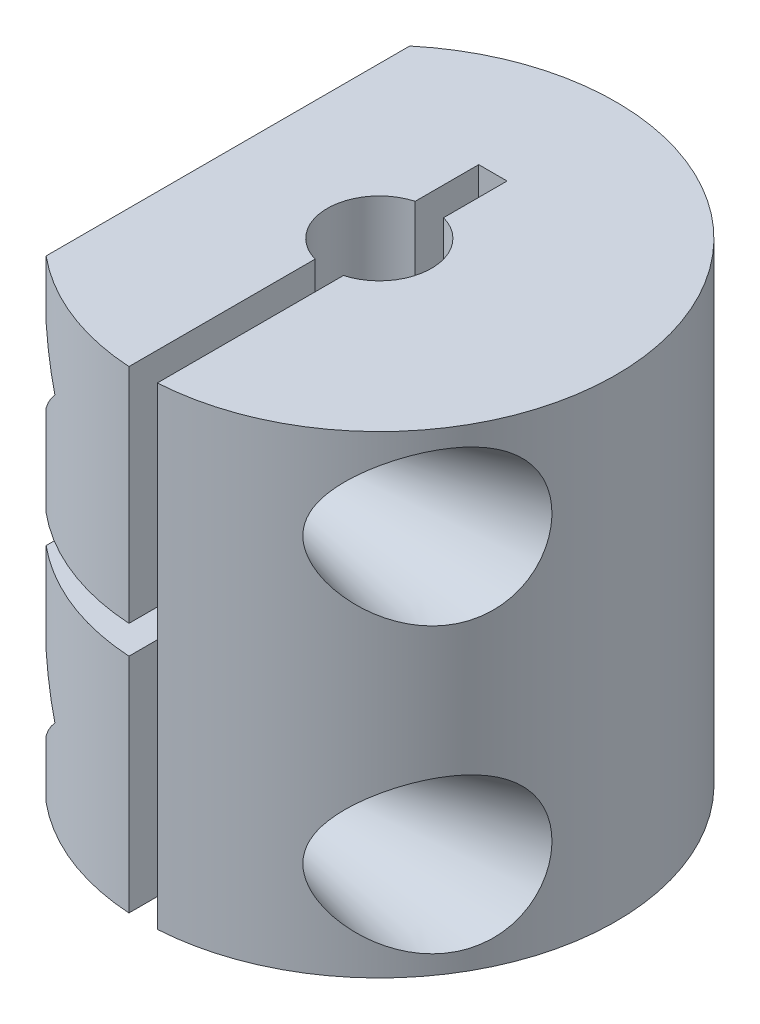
ISO-10303-21;
HEADER;
FILE_DESCRIPTION(('STEP AP214'),'2;1');
FILE_NAME('part.step','',(''),(''),'','','');
FILE_SCHEMA(('AUTOMOTIVE_DESIGN { 1 0 10303 214 1 1 1 1 }'));
ENDSEC;
DATA;
#1=APPLICATION_CONTEXT('core data for automotive mechanical design processes');
#2=APPLICATION_PROTOCOL_DEFINITION('international standard','automotive_design',2000,#1);
#3=PRODUCT_CONTEXT('',#1,'mechanical');
#4=PRODUCT('Part','Part','',(#3));
#5=PRODUCT_RELATED_PRODUCT_CATEGORY('part','',(#4));
#6=PRODUCT_DEFINITION_FORMATION('','',#4);
#7=PRODUCT_DEFINITION_CONTEXT('part definition',#1,'design');
#8=PRODUCT_DEFINITION('design','',#6,#7);
#9=PRODUCT_DEFINITION_SHAPE('','',#8);
#10=(LENGTH_UNIT() NAMED_UNIT(*) SI_UNIT(.MILLI.,.METRE.));
#11=(NAMED_UNIT(*) PLANE_ANGLE_UNIT() SI_UNIT($,.RADIAN.));
#12=(NAMED_UNIT(*) SI_UNIT($,.STERADIAN.) SOLID_ANGLE_UNIT());
#13=UNCERTAINTY_MEASURE_WITH_UNIT(LENGTH_MEASURE(1.E-05),#10,'distance_accuracy_value','');
#14=(GEOMETRIC_REPRESENTATION_CONTEXT(3) GLOBAL_UNCERTAINTY_ASSIGNED_CONTEXT((#13)) GLOBAL_UNIT_ASSIGNED_CONTEXT((#10,
#11,#12)) REPRESENTATION_CONTEXT('',''));
#15=CARTESIAN_POINT('',(0.,0.,0.));
#16=DIRECTION('',(0.,0.,1.));
#17=DIRECTION('',(1.,0.,0.));
#18=AXIS2_PLACEMENT_3D('',#15,#16,#17);
#19=CARTESIAN_POINT('',(-12.5,20.,7.56161551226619));
#20=DIRECTION('',(1.,0.,0.));
#21=DIRECTION('',(0.,0.,-1.));
#22=AXIS2_PLACEMENT_3D('',#19,#20,#21);
#23=CYLINDRICAL_SURFACE('',#22,1.5);
#24=CARTESIAN_POINT('',(-0.750000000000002,20.,7.56161551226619));
#25=DIRECTION('',(-1.,0.,0.));
#26=DIRECTION('',(0.,0.,1.));
#27=AXIS2_PLACEMENT_3D('',#24,#25,#26);
#28=CIRCLE('',#27,1.5);
#29=CARTESIAN_POINT('',(-0.750000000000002,20.,6.06161551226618));
#30=VERTEX_POINT('',#29);
#31=EDGE_CURVE('E404',#30,#30,#28,.F.);
#32=CARTESIAN_POINT('',(-5.,20.,7.56161551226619));
#33=DIRECTION('',(-1.,0.,0.));
#34=DIRECTION('',(0.,0.,1.));
#35=AXIS2_PLACEMENT_3D('',#32,#33,#34);
#36=CIRCLE('',#35,1.5);
#37=CARTESIAN_POINT('',(-5.,20.,6.06161551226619));
#38=VERTEX_POINT('',#37);
#39=EDGE_CURVE('E351',#38,#38,#36,.T.);
#40=CARTESIAN_POINT('',(-0.750000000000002,20.,6.06161551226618));
#41=CARTESIAN_POINT('',(-0.794270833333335,20.,6.06161551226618));
#42=CARTESIAN_POINT('',(-0.838541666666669,20.,6.06161551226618));
#43=CARTESIAN_POINT('',(-0.927083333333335,20.,6.06161551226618));
#44=CARTESIAN_POINT('',(-0.971354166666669,20.,6.06161551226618));
#45=CARTESIAN_POINT('',(-1.05989583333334,20.,6.06161551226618));
#46=CARTESIAN_POINT('',(-1.10416666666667,20.,6.06161551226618));
#47=CARTESIAN_POINT('',(-1.19270833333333,20.,6.06161551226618));
#48=CARTESIAN_POINT('',(-1.23697916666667,20.,6.06161551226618));
#49=CARTESIAN_POINT('',(-1.32552083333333,20.,6.06161551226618));
#50=CARTESIAN_POINT('',(-1.36979166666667,20.,6.06161551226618));
#51=CARTESIAN_POINT('',(-1.45833333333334,20.,6.06161551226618));
#52=CARTESIAN_POINT('',(-1.50260416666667,20.,6.06161551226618));
#53=CARTESIAN_POINT('',(-1.59114583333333,20.,6.06161551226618));
#54=CARTESIAN_POINT('',(-1.63541666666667,20.,6.06161551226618));
#55=CARTESIAN_POINT('',(-1.72395833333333,20.,6.06161551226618));
#56=CARTESIAN_POINT('',(-1.76822916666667,20.,6.06161551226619));
#57=CARTESIAN_POINT('',(-1.85677083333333,20.,6.06161551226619));
#58=CARTESIAN_POINT('',(-1.90104166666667,20.,6.06161551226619));
#59=CARTESIAN_POINT('',(-1.98958333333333,20.,6.06161551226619));
#60=CARTESIAN_POINT('',(-2.03385416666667,20.,6.06161551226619));
#61=CARTESIAN_POINT('',(-2.12239583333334,20.,6.06161551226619));
#62=CARTESIAN_POINT('',(-2.16666666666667,20.,6.06161551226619));
#63=CARTESIAN_POINT('',(-2.25520833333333,20.,6.06161551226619));
#64=CARTESIAN_POINT('',(-2.29947916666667,20.,6.06161551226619));
#65=CARTESIAN_POINT('',(-2.38802083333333,20.,6.06161551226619));
#66=CARTESIAN_POINT('',(-2.43229166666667,20.,6.06161551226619));
#67=CARTESIAN_POINT('',(-2.52083333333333,20.,6.06161551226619));
#68=CARTESIAN_POINT('',(-2.56510416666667,20.,6.06161551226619));
#69=CARTESIAN_POINT('',(-2.65364583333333,20.,6.06161551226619));
#70=CARTESIAN_POINT('',(-2.69791666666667,20.,6.06161551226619));
#71=CARTESIAN_POINT('',(-2.78645833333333,20.,6.06161551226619));
#72=CARTESIAN_POINT('',(-2.83072916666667,20.,6.06161551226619));
#73=CARTESIAN_POINT('',(-2.91927083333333,20.,6.06161551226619));
#74=CARTESIAN_POINT('',(-2.96354166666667,20.,6.06161551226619));
#75=CARTESIAN_POINT('',(-3.05208333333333,20.,6.06161551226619));
#76=CARTESIAN_POINT('',(-3.09635416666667,20.,6.06161551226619));
#77=CARTESIAN_POINT('',(-3.18489583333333,20.,6.06161551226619));
#78=CARTESIAN_POINT('',(-3.22916666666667,20.,6.06161551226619));
#79=CARTESIAN_POINT('',(-3.31770833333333,20.,6.06161551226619));
#80=CARTESIAN_POINT('',(-3.36197916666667,20.,6.06161551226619));
#81=CARTESIAN_POINT('',(-3.45052083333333,20.,6.06161551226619));
#82=CARTESIAN_POINT('',(-3.49479166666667,20.,6.06161551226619));
#83=CARTESIAN_POINT('',(-3.58333333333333,20.,6.06161551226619));
#84=CARTESIAN_POINT('',(-3.62760416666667,20.,6.06161551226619));
#85=CARTESIAN_POINT('',(-3.71614583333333,20.,6.06161551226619));
#86=CARTESIAN_POINT('',(-3.76041666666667,20.,6.06161551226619));
#87=CARTESIAN_POINT('',(-3.84895833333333,20.,6.06161551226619));
#88=CARTESIAN_POINT('',(-3.89322916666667,20.,6.06161551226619));
#89=CARTESIAN_POINT('',(-3.98177083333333,20.,6.06161551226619));
#90=CARTESIAN_POINT('',(-4.02604166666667,20.,6.06161551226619));
#91=CARTESIAN_POINT('',(-4.11458333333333,20.,6.06161551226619));
#92=CARTESIAN_POINT('',(-4.15885416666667,20.,6.06161551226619));
#93=CARTESIAN_POINT('',(-4.24739583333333,20.,6.06161551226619));
#94=CARTESIAN_POINT('',(-4.29166666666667,20.,6.06161551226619));
#95=CARTESIAN_POINT('',(-4.38020833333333,20.,6.06161551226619));
#96=CARTESIAN_POINT('',(-4.42447916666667,20.,6.06161551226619));
#97=CARTESIAN_POINT('',(-4.51302083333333,20.,6.06161551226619));
#98=CARTESIAN_POINT('',(-4.55729166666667,20.,6.06161551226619));
#99=CARTESIAN_POINT('',(-4.64583333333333,20.,6.06161551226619));
#100=CARTESIAN_POINT('',(-4.69010416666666,20.,6.06161551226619));
#101=CARTESIAN_POINT('',(-4.77864583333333,20.,6.06161551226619));
#102=CARTESIAN_POINT('',(-4.82291666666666,20.,6.06161551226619));
#103=CARTESIAN_POINT('',(-4.91145833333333,20.,6.06161551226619));
#104=CARTESIAN_POINT('',(-4.95572916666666,20.,6.06161551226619));
#105=CARTESIAN_POINT('',(-5.,20.,6.06161551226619));
#106=B_SPLINE_CURVE_WITH_KNOTS('',3,(#40,#41,#42,#43,#44,#45,#46,#47,#48,#49,#50,#51,#52,#53,
#54,#55,#56,#57,#58,#59,#60,#61,#62,#63,#64,#65,#66,#67,#68,#69,#70,#71,#72,#73,#74,#75,#76,#77,
#78,#79,#80,#81,#82,#83,#84,#85,#86,#87,#88,#89,#90,#91,#92,#93,#94,#95,#96,#97,#98,#99,#100,
#101,#102,#103,#104,#105),.UNSPECIFIED.,.F.,.F.,(4,2,2,2,2,2,2,2,2,2,2,2,2,2,2,2,2,2,2,2,2,2,2,
2,2,2,2,2,2,2,2,2,4),(0.,0.132812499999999,0.265625,0.3984375,0.531249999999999,0.6640625,
0.796874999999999,0.929687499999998,1.0625,1.1953125,1.328125,1.4609375,1.59375,1.7265625,
1.859375,1.9921875,2.125,2.2578125,2.390625,2.5234375,2.65625,2.7890625,2.921875,3.0546875,
3.1875,3.3203125,3.453125,3.5859375,3.71875,3.8515625,3.98437499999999,4.11718749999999,
4.24999999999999),.UNSPECIFIED.);
#107=EDGE_CURVE('BSEAM43',#30,#38,#106,.T.);
#108=ORIENTED_EDGE('',*,*,#31,.T.);
#109=ORIENTED_EDGE('',*,*,#39,.T.);
#110=ORIENTED_EDGE('',*,*,#107,.T.);
#111=ORIENTED_EDGE('',*,*,#107,.F.);
#112=EDGE_LOOP('',(#108,#110,#109,#111));
#113=FACE_BOUND('',#112,.T.);
#114=ADVANCED_FACE('F43',(#113),#23,.F.);
#115=CARTESIAN_POINT('',(0.,25.,0.));
#116=DIRECTION('',(0.,-1.,0.));
#117=DIRECTION('',(0.,0.,-1.));
#118=AXIS2_PLACEMENT_3D('',#115,#116,#117);
#119=CYLINDRICAL_SURFACE('',#118,12.5);
#120=DIRECTION('',(0.,1.,0.));
#121=VECTOR('',#120,1.);
#122=CARTESIAN_POINT('',(-8.,0.,9.60468635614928));
#123=LINE('',#122,#121);
#124=CARTESIAN_POINT('',(-8.,21.9612974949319,9.60468635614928));
#125=VERTEX_POINT('',#124);
#126=CARTESIAN_POINT('',(-8.,25.,9.60468635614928));
#127=VERTEX_POINT('',#126);
#128=EDGE_CURVE('E355',#125,#127,#123,.T.);
#129=ORIENTED_EDGE('',*,*,#128,.F.);
#130=CARTESIAN_POINT('',(0.,38.597102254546,0.));
#131=DIRECTION('',(0.,0.5,0.866025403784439));
#132=DIRECTION('',(0.,-0.866025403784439,0.5));
#133=AXIS2_PLACEMENT_3D('',#130,#131,#132);
#134=ELLIPSE('',#133,25.,12.5);
#135=CARTESIAN_POINT('',(-6.4004632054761,20.,10.7370419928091));
#136=VERTEX_POINT('',#135);
#137=EDGE_CURVE('E342',#125,#136,#134,.T.);
#138=ORIENTED_EDGE('',*,*,#137,.T.);
#139=CARTESIAN_POINT('',(0.,1.40289774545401,0.));
#140=DIRECTION('',(0.,-0.5,0.866025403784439));
#141=DIRECTION('',(0.,-0.866025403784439,-0.5));
#142=AXIS2_PLACEMENT_3D('',#139,#140,#141);
#143=ELLIPSE('',#142,25.,12.5);
#144=CARTESIAN_POINT('',(-8.,18.0387025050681,9.60468635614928));
#145=VERTEX_POINT('',#144);
#146=EDGE_CURVE('E287',#136,#145,#143,.T.);
#147=ORIENTED_EDGE('',*,*,#146,.T.);
#148=CARTESIAN_POINT('',(-8.,13.25,9.60468635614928));
#149=VERTEX_POINT('',#148);
#150=EDGE_CURVE('E366',#149,#145,#123,.T.);
#151=ORIENTED_EDGE('',*,*,#150,.F.);
#152=CARTESIAN_POINT('',(0.,13.25,0.));
#153=DIRECTION('',(0.,-1.,0.));
#154=DIRECTION('',(0.,0.,-1.));
#155=AXIS2_PLACEMENT_3D('',#152,#153,#154);
#156=CIRCLE('',#155,12.5);
#157=CARTESIAN_POINT('',(-0.750000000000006,13.25,12.4774797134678));
#158=VERTEX_POINT('',#157);
#159=EDGE_CURVE('E378',#158,#149,#156,.T.);
#160=ORIENTED_EDGE('',*,*,#159,.F.);
#161=DIRECTION('',(0.,-1.,0.));
#162=VECTOR('',#161,1.);
#163=CARTESIAN_POINT('',(-0.750000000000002,25.,12.4774797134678));
#164=LINE('',#163,#162);
#165=CARTESIAN_POINT('',(-0.750000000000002,25.,12.4774797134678));
#166=VERTEX_POINT('',#165);
#167=EDGE_CURVE('E575',#158,#166,#164,.F.);
#168=ORIENTED_EDGE('',*,*,#167,.T.);
#169=CARTESIAN_POINT('',(0.,25.,0.));
#170=DIRECTION('',(0.,1.,0.));
#171=DIRECTION('',(0.,0.,1.));
#172=AXIS2_PLACEMENT_3D('',#169,#170,#171);
#173=CIRCLE('',#172,12.5);
#174=EDGE_CURVE('E560',#127,#166,#173,.T.);
#175=ORIENTED_EDGE('',*,*,#174,.F.);
#176=EDGE_LOOP('',(#129,#138,#147,#151,#160,#168,#175));
#177=FACE_BOUND('',#176,.T.);
#178=ADVANCED_FACE('F450',(#177),#119,.T.);
#179=CARTESIAN_POINT('',(-8.,6.96129749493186,9.60468635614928));
#180=VERTEX_POINT('',#179);
#181=CARTESIAN_POINT('',(-8.,11.75,9.60468635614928));
#182=VERTEX_POINT('',#181);
#183=EDGE_CURVE('E365',#180,#182,#123,.T.);
#184=ORIENTED_EDGE('',*,*,#183,.F.);
#185=CARTESIAN_POINT('',(0.,23.597102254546,0.));
#186=DIRECTION('',(0.,0.5,0.866025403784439));
#187=DIRECTION('',(0.,-0.866025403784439,0.5));
#188=AXIS2_PLACEMENT_3D('',#185,#186,#187);
#189=ELLIPSE('',#188,25.,12.5);
#190=CARTESIAN_POINT('',(-6.4004632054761,4.99999999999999,10.7370419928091));
#191=VERTEX_POINT('',#190);
#192=EDGE_CURVE('E348',#180,#191,#189,.T.);
#193=ORIENTED_EDGE('',*,*,#192,.T.);
#194=CARTESIAN_POINT('',(0.,-13.597102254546,0.));
#195=DIRECTION('',(0.,-0.5,0.866025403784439));
#196=DIRECTION('',(0.,-0.866025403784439,-0.5));
#197=AXIS2_PLACEMENT_3D('',#194,#195,#196);
#198=ELLIPSE('',#197,25.,12.5);
#199=CARTESIAN_POINT('',(-8.,3.03870250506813,9.60468635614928));
#200=VERTEX_POINT('',#199);
#201=EDGE_CURVE('E345',#191,#200,#198,.T.);
#202=ORIENTED_EDGE('',*,*,#201,.T.);
#203=CARTESIAN_POINT('',(-8.,0.,9.60468635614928));
#204=VERTEX_POINT('',#203);
#205=EDGE_CURVE('E362',#204,#200,#123,.T.);
#206=ORIENTED_EDGE('',*,*,#205,.F.);
#207=CARTESIAN_POINT('',(0.,0.,0.));
#208=DIRECTION('',(0.,1.,0.));
#209=DIRECTION('',(0.,0.,1.));
#210=AXIS2_PLACEMENT_3D('',#207,#208,#209);
#211=CIRCLE('',#210,12.5);
#212=CARTESIAN_POINT('',(-0.750000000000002,0.,12.4774797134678));
#213=VERTEX_POINT('',#212);
#214=EDGE_CURVE('E561',#204,#213,#211,.T.);
#215=ORIENTED_EDGE('',*,*,#214,.T.);
#216=CARTESIAN_POINT('',(-0.750000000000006,11.75,12.4774797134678));
#217=VERTEX_POINT('',#216);
#218=EDGE_CURVE('E572',#213,#217,#164,.F.);
#219=ORIENTED_EDGE('',*,*,#218,.T.);
#220=CARTESIAN_POINT('',(0.,11.75,0.));
#221=DIRECTION('',(0.,1.,0.));
#222=DIRECTION('',(0.,0.,1.));
#223=AXIS2_PLACEMENT_3D('',#220,#221,#222);
#224=CIRCLE('',#223,12.5);
#225=EDGE_CURVE('E384',#182,#217,#224,.T.);
#226=ORIENTED_EDGE('',*,*,#225,.F.);
#227=EDGE_LOOP('',(#184,#193,#202,#206,#215,#219,#226));
#228=FACE_BOUND('',#227,.T.);
#229=ADVANCED_FACE('F456',(#228),#119,.T.);
#230=CARTESIAN_POINT('',(6.90718964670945,18.6730679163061,10.4182883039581));
#231=CARTESIAN_POINT('',(6.84395636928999,18.8035590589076,10.4602109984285));
#232=CARTESIAN_POINT('',(6.7874820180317,18.9392335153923,10.4968195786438));
#233=CARTESIAN_POINT('',(6.71662059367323,19.1493907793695,10.5421914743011));
#234=CARTESIAN_POINT('',(6.69530558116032,19.2205657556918,10.5557270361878));
#235=CARTESIAN_POINT('',(6.65788873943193,19.3648163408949,10.5793670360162));
#236=CARTESIAN_POINT('',(6.64178415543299,19.4378909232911,10.5894732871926));
#237=CARTESIAN_POINT('',(6.61517912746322,19.5862528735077,10.6061140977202));
#238=CARTESIAN_POINT('',(6.60473835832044,19.6615553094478,10.612610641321));
#239=CARTESIAN_POINT('',(6.59011287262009,19.8130050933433,10.621698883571));
#240=CARTESIAN_POINT('',(6.58592807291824,19.8891524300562,10.6242906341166));
#241=CARTESIAN_POINT('',(6.58398828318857,20.041533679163,10.6254929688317));
#242=CARTESIAN_POINT('',(6.58623065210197,20.1177675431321,10.6241051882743));
#243=CARTESIAN_POINT('',(6.59703658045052,20.2695873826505,10.6173981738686));
#244=CARTESIAN_POINT('',(6.60559984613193,20.345173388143,10.6120791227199));
#245=CARTESIAN_POINT('',(6.6371955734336,20.5497731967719,10.5923658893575));
#246=CARTESIAN_POINT('',(6.66622601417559,20.6775432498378,10.5741821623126));
#247=CARTESIAN_POINT('',(6.73941093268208,20.9266049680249,10.5276873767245));
#248=CARTESIAN_POINT('',(6.78357594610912,21.0478920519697,10.4993692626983));
#249=CARTESIAN_POINT('',(6.91406628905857,21.3541912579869,10.4141625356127));
#250=CARTESIAN_POINT('',(7.00972815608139,21.5333264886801,10.3503564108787));
#251=CARTESIAN_POINT('',(7.16741524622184,21.7870554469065,10.2412077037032));
#252=CARTESIAN_POINT('',(7.22246751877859,21.869285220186,10.2024940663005));
#253=CARTESIAN_POINT('',(7.33633236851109,22.0289557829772,10.1209245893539));
#254=CARTESIAN_POINT('',(7.39514401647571,22.1063977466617,10.0780697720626));
#255=CARTESIAN_POINT('',(7.54767411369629,22.2965855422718,9.96472861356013));
#256=CARTESIAN_POINT('',(7.64333825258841,22.4062297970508,9.89165801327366));
#257=CARTESIAN_POINT('',(7.83912160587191,22.6152711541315,9.73723489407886));
#258=CARTESIAN_POINT('',(7.93924305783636,22.7146630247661,9.65587818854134));
#259=CARTESIAN_POINT('',(8.14228231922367,22.9035461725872,9.48529579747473));
#260=CARTESIAN_POINT('',(8.24520239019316,22.9930291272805,9.39606360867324));
#261=CARTESIAN_POINT('',(8.45239856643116,23.1620363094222,9.21012144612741));
#262=CARTESIAN_POINT('',(8.55667443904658,23.2415622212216,9.11341274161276));
#263=CARTESIAN_POINT('',(8.76855966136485,23.3926596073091,8.90980232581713));
#264=CARTESIAN_POINT('',(8.87617710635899,23.4639294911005,8.80268489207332));
#265=CARTESIAN_POINT('',(9.09064783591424,23.5952517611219,8.5810201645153));
#266=CARTESIAN_POINT('',(9.19750103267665,23.6553028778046,8.46647203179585));
#267=CARTESIAN_POINT('',(9.40928136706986,23.7633692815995,8.23046327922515));
#268=CARTESIAN_POINT('',(9.5142110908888,23.8114020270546,8.10901300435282));
#269=CARTESIAN_POINT('',(9.72131280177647,23.8945916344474,7.85953798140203));
#270=CARTESIAN_POINT('',(9.82348550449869,23.929751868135,7.73151496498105));
#271=CARTESIAN_POINT('',(10.003257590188,23.9802331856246,7.496794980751));
#272=CARTESIAN_POINT('',(10.0815550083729,23.9981575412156,7.39118817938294));
#273=CARTESIAN_POINT('',(10.2352945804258,24.0246097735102,7.17677745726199));
#274=CARTESIAN_POINT('',(10.3107373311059,24.0331396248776,7.0679742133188));
#275=CARTESIAN_POINT('',(10.4582755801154,24.040178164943,6.8477759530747));
#276=CARTESIAN_POINT('',(10.5303708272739,24.0386861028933,6.73638074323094));
#277=CARTESIAN_POINT('',(10.6706677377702,24.0250744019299,6.51186305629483));
#278=CARTESIAN_POINT('',(10.738871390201,24.0129602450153,6.39874149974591));
#279=CARTESIAN_POINT('',(10.8715263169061,23.9774183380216,6.17069413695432));
#280=CARTESIAN_POINT('',(10.9359392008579,23.9538917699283,6.05576121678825));
#281=CARTESIAN_POINT('',(11.0598764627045,23.8950771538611,5.82633006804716));
#282=CARTESIAN_POINT('',(11.1194033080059,23.8597950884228,5.71183164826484));
#283=CARTESIAN_POINT('',(11.2332176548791,23.7772535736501,5.48461136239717));
#284=CARTESIAN_POINT('',(11.2875072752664,23.7299989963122,5.37188879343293));
#285=CARTESIAN_POINT('',(11.3906157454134,23.6235139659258,5.149647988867));
#286=CARTESIAN_POINT('',(11.4394354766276,23.5642854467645,5.04012923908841));
#287=CARTESIAN_POINT('',(11.5252056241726,23.4430175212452,4.84043290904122));
#288=CARTESIAN_POINT('',(11.5628667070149,23.3824637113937,4.74965492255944));
#289=CARTESIAN_POINT('',(11.6340489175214,23.2529446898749,4.57252859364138));
#290=CARTESIAN_POINT('',(11.6675687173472,23.1839767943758,4.48618167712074));
#291=CARTESIAN_POINT('',(11.7305146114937,23.0381627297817,4.31891324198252));
#292=CARTESIAN_POINT('',(11.7599431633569,22.9613213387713,4.23798848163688));
#293=CARTESIAN_POINT('',(11.8148889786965,22.8002829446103,4.08230535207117));
#294=CARTESIAN_POINT('',(11.8404047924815,22.7160832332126,4.00754927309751));
#295=CARTESIAN_POINT('',(11.886281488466,22.5463144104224,3.86927611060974));
#296=CARTESIAN_POINT('',(11.9068605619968,22.461134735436,3.80535300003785));
#297=CARTESIAN_POINT('',(11.9449220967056,22.2855143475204,3.68413723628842));
#298=CARTESIAN_POINT('',(11.9624034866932,22.1950718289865,3.6268468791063));
#299=CARTESIAN_POINT('',(12.0104847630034,21.9168770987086,3.46567225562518));
#300=CARTESIAN_POINT('',(12.0367653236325,21.7220911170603,3.37234885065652));
#301=CARTESIAN_POINT('',(12.0797618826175,21.314969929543,3.21499667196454));
#302=CARTESIAN_POINT('',(12.0962448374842,21.1023348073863,3.15168841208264));
#303=CARTESIAN_POINT('',(12.1199879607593,20.6692423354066,3.05911419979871));
#304=CARTESIAN_POINT('',(12.1272461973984,20.4487833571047,3.02985537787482));
#305=CARTESIAN_POINT('',(12.1332582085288,19.9982069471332,3.00569993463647));
#306=CARTESIAN_POINT('',(12.1317090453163,19.7680192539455,3.01202724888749));
#307=CARTESIAN_POINT('',(12.1192534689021,19.3119108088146,3.06175387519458));
#308=CARTESIAN_POINT('',(12.1083460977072,19.0859904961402,3.10515698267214));
#309=CARTESIAN_POINT('',(12.0760803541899,18.6433059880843,3.22836629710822));
#310=CARTESIAN_POINT('',(12.0546484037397,18.4266181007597,3.30842852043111));
#311=CARTESIAN_POINT('',(11.9996351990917,18.0107936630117,3.50269770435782));
#312=CARTESIAN_POINT('',(11.9660565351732,17.8116533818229,3.61689738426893));
#313=CARTESIAN_POINT('',(11.8858933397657,17.4424633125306,3.87206148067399));
#314=CARTESIAN_POINT('',(11.8396889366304,17.2717677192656,4.01221001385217));
#315=CARTESIAN_POINT('',(11.7323271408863,16.9583907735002,4.31605860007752));
#316=CARTESIAN_POINT('',(11.6711747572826,16.8157000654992,4.47975075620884));
#317=CARTESIAN_POINT('',(11.5353748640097,16.5665130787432,4.81842633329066));
#318=CARTESIAN_POINT('',(11.4612501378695,16.4589612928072,4.99284517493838));
#319=CARTESIAN_POINT('',(11.2983932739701,16.275484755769,5.35116912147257));
#320=CARTESIAN_POINT('',(11.2096607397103,16.1995608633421,5.53507448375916));
#321=CARTESIAN_POINT('',(11.0168315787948,16.0781396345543,5.90970840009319));
#322=CARTESIAN_POINT('',(10.9124682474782,16.033266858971,6.10050005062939));
#323=CARTESIAN_POINT('',(10.6916170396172,15.9746710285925,6.47978209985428));
#324=CARTESIAN_POINT('',(10.5751234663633,15.9609626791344,6.66827137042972));
#325=CARTESIAN_POINT('',(10.3186334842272,15.9621324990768,7.05949363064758));
#326=CARTESIAN_POINT('',(10.1774675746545,15.9804024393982,7.26144143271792));
#327=CARTESIAN_POINT('',(9.88631948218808,16.0481762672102,7.65313026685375));
#328=CARTESIAN_POINT('',(9.73633612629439,16.0976843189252,7.84286966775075));
#329=CARTESIAN_POINT('',(9.40193532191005,16.2361731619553,8.24216996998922));
#330=CARTESIAN_POINT('',(9.21632777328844,16.3308082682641,8.44879233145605));
#331=CARTESIAN_POINT('',(8.9357093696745,16.4986034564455,8.74194480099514));
#332=CARTESIAN_POINT('',(8.84163302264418,16.558972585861,8.83701927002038));
#333=CARTESIAN_POINT('',(8.65348054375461,16.6880216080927,9.02134015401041));
#334=CARTESIAN_POINT('',(8.55940441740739,16.7566994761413,9.11058798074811));
#335=CARTESIAN_POINT('',(8.35464279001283,16.9156394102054,9.29907156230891));
#336=CARTESIAN_POINT('',(8.24411017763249,17.0075428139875,9.39709315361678));
#337=CARTESIAN_POINT('',(8.02556652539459,17.202739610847,9.5844141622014));
#338=CARTESIAN_POINT('',(7.91755686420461,17.3060390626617,9.67370889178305));
#339=CARTESIAN_POINT('',(7.70655655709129,17.5237827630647,9.84261966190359));
#340=CARTESIAN_POINT('',(7.60354512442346,17.6381736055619,9.9222783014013));
#341=CARTESIAN_POINT('',(7.40472531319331,17.8789934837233,10.0715162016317));
#342=CARTESIAN_POINT('',(7.30890767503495,18.0054065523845,10.1411085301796));
#343=CARTESIAN_POINT('',(7.1614628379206,18.2221215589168,10.2454068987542));
#344=CARTESIAN_POINT('',(7.10656434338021,18.3085611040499,10.2835174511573));
#345=CARTESIAN_POINT('',(7.00232267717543,18.4867809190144,10.3547796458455));
#346=CARTESIAN_POINT('',(6.95298370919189,18.5785651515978,10.387927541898));
#347=CARTESIAN_POINT('',(6.90718964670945,18.6730679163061,10.4182883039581));
#348=B_SPLINE_CURVE_WITH_KNOTS('',3,(#230,#231,#232,#233,#234,#235,#236,#237,#238,#239,#240,
#241,#242,#243,#244,#245,#246,#247,#248,#249,#250,#251,#252,#253,#254,#255,#256,#257,#258,#259,
#260,#261,#262,#263,#264,#265,#266,#267,#268,#269,#270,#271,#272,#273,#274,#275,#276,#277,#278,
#279,#280,#281,#282,#283,#284,#285,#286,#287,#288,#289,#290,#291,#292,#293,#294,#295,#296,#297,
#298,#299,#300,#301,#302,#303,#304,#305,#306,#307,#308,#309,#310,#311,#312,#313,#314,#315,#316,
#317,#318,#319,#320,#321,#322,#323,#324,#325,#326,#327,#328,#329,#330,#331,#332,#333,#334,#335,
#336,#337,#338,#339,#340,#341,#342,#343,#344,#345,#346,#347),.UNSPECIFIED.,.T.,.F.,(4,2,2,2,2,2,
2,2,2,2,2,2,2,2,2,2,2,2,2,2,2,2,2,2,2,2,2,2,2,2,2,2,2,2,2,2,2,2,2,2,2,2,2,2,2,2,2,2,2,2,2,2,2,2,
2,2,2,2,4),(0.,0.452484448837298,0.678817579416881,0.90503085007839,1.1335834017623,
1.36213291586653,1.59058852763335,1.8190335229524,2.21410786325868,2.60945778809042,
3.24416778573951,3.56279762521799,3.88134901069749,4.3691347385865,4.85716815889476,
5.34560841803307,5.83396593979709,6.33664214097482,6.83937519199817,7.34137365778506,
7.84324053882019,8.24092066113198,8.63851717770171,9.03614347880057,9.43356468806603,
9.83449023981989,10.2352120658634,10.6357710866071,11.0362654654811,11.382127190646,
11.7280995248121,12.0738631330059,12.4197545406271,12.7447675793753,13.0698927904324,
13.7194937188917,14.3839845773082,15.0486145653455,15.7362403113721,16.4239364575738,
17.116510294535,17.8089365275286,18.4824575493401,19.1557531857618,19.806414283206,
20.4570930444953,21.120506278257,21.7842324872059,22.5226759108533,23.2612177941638,
24.1380136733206,24.5779769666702,25.017833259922,25.5392045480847,26.060854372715,
26.5801065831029,27.098678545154,27.426125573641,27.7538185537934),.UNSPECIFIED.);
#349=CARTESIAN_POINT('',(6.90718964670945,18.6730679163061,10.4182883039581));
#350=VERTEX_POINT('',#349);
#351=EDGE_CURVE('E403',#350,#350,#348,.T.);
#352=ORIENTED_EDGE('',*,*,#351,.T.);
#353=EDGE_LOOP('',(#352));
#354=FACE_BOUND('',#353,.T.);
#355=CARTESIAN_POINT('',(6.80358470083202,3.9073949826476,10.4862402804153));
#356=CARTESIAN_POINT('',(6.75252266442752,4.03520784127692,10.519371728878));
#357=CARTESIAN_POINT('',(6.70863868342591,4.16735343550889,10.5473152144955));
#358=CARTESIAN_POINT('',(6.65668035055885,4.37048596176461,10.5801238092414));
#359=CARTESIAN_POINT('',(6.64167235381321,4.43901429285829,10.5895421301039));
#360=CARTESIAN_POINT('',(6.61669365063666,4.57733267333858,10.6051678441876));
#361=CARTESIAN_POINT('',(6.60672077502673,4.64712216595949,10.6113766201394));
#362=CARTESIAN_POINT('',(6.59208875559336,4.7879339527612,10.6204727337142));
#363=CARTESIAN_POINT('',(6.58746450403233,4.85896130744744,10.6233382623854));
#364=CARTESIAN_POINT('',(6.58380747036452,5.00121632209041,10.6256051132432));
#365=CARTESIAN_POINT('',(6.58477468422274,5.07244398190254,10.6250064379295));
#366=CARTESIAN_POINT('',(6.59226909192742,5.21450070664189,10.6203581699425));
#367=CARTESIAN_POINT('',(6.59879689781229,5.2853297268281,10.6163081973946));
#368=CARTESIAN_POINT('',(6.61718193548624,5.42602800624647,10.6048582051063));
#369=CARTESIAN_POINT('',(6.62904135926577,5.49589685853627,10.5974568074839));
#370=CARTESIAN_POINT('',(6.66996704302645,5.69313788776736,10.5717802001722));
#371=CARTESIAN_POINT('',(6.70508528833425,5.81879639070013,10.5496128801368));
#372=CARTESIAN_POINT('',(6.78920465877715,6.06303873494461,10.4956749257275));
#373=CARTESIAN_POINT('',(6.83821297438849,6.18161887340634,10.4638993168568));
#374=CARTESIAN_POINT('',(6.98572578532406,6.49315808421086,10.3663848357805));
#375=CARTESIAN_POINT('',(7.09457998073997,6.67874271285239,10.2925987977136));
#376=CARTESIAN_POINT('',(7.27175528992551,6.94037311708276,10.167444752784));
#377=CARTESIAN_POINT('',(7.33327198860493,7.02495059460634,10.1232069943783));
#378=CARTESIAN_POINT('',(7.45993430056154,7.18878935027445,10.0302306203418));
#379=CARTESIAN_POINT('',(7.52507968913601,7.26805095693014,9.98149228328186));
#380=CARTESIAN_POINT('',(7.69063754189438,7.4589955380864,9.85492934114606));
#381=CARTESIAN_POINT('',(7.79270029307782,7.56755142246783,9.77454746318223));
#382=CARTESIAN_POINT('',(8.0006020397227,7.77379425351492,9.60512233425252));
#383=CARTESIAN_POINT('',(8.10644275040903,7.87147617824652,9.51607511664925));
#384=CARTESIAN_POINT('',(8.3202715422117,8.05618071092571,9.32969516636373));
#385=CARTESIAN_POINT('',(8.42826097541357,8.14319634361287,9.23235708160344));
#386=CARTESIAN_POINT('',(8.64496436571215,8.30637109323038,9.02976153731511));
#387=CARTESIAN_POINT('',(8.75367820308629,8.38253195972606,8.92450535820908));
#388=CARTESIAN_POINT('',(8.9727396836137,8.52494067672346,8.704281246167));
#389=CARTESIAN_POINT('',(9.08307989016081,8.59097666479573,8.58916857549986));
#390=CARTESIAN_POINT('',(9.30226320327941,8.71070042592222,8.3512906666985));
#391=CARTESIAN_POINT('',(9.41110611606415,8.76438661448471,8.22852444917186));
#392=CARTESIAN_POINT('',(9.62601666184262,8.85835614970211,7.97604146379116));
#393=CARTESIAN_POINT('',(9.73208897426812,8.89866365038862,7.84633771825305));
#394=CARTESIAN_POINT('',(9.94056861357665,8.96482735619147,7.58047476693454));
#395=CARTESIAN_POINT('',(10.0429772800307,8.99068889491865,7.44431796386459));
#396=CARTESIAN_POINT('',(10.2170561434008,9.02198314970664,7.20262730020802));
#397=CARTESIAN_POINT('',(10.2898037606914,9.03097655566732,7.09832095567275));
#398=CARTESIAN_POINT('',(10.432241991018,9.03976977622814,6.88727234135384));
#399=CARTESIAN_POINT('',(10.5019333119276,9.03957173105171,6.78053064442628));
#400=CARTESIAN_POINT('',(10.6378160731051,9.0294420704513,6.56529252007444));
#401=CARTESIAN_POINT('',(10.7040077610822,9.01951114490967,6.45679621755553));
#402=CARTESIAN_POINT('',(10.8324340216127,8.9894345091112,6.23893831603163));
#403=CARTESIAN_POINT('',(10.8946705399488,8.96929386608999,6.12957717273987));
#404=CARTESIAN_POINT('',(11.0152905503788,8.91821304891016,5.91009084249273));
#405=CARTESIAN_POINT('',(11.0736406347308,8.8871908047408,5.79996626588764));
#406=CARTESIAN_POINT('',(11.185588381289,8.81414520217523,5.58101451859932));
#407=CARTESIAN_POINT('',(11.2391882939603,8.77212709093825,5.47218675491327));
#408=CARTESIAN_POINT('',(11.3414023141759,8.67703420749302,5.2570689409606));
#409=CARTESIAN_POINT('',(11.3900173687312,8.62396154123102,5.15077841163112));
#410=CARTESIAN_POINT('',(11.4821226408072,8.5069179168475,4.94205128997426));
#411=CARTESIAN_POINT('',(11.525613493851,8.44294831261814,4.83961422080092));
#412=CARTESIAN_POINT('',(11.6025873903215,8.31272726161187,4.65177584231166));
#413=CARTESIAN_POINT('',(11.636645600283,8.24764730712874,4.56579541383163));
#414=CARTESIAN_POINT('',(11.7008349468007,8.10970990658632,4.39869016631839));
#415=CARTESIAN_POINT('',(11.7309648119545,8.03684995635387,4.31756692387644));
#416=CARTESIAN_POINT('',(11.7873874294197,7.88393258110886,4.16105960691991));
#417=CARTESIAN_POINT('',(11.8136822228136,7.80387902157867,4.08567248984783));
#418=CARTESIAN_POINT('',(11.8626348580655,7.63712190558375,3.94128269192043));
#419=CARTESIAN_POINT('',(11.8852913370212,7.55041587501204,3.87228240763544));
#420=CARTESIAN_POINT('',(11.9263093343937,7.37471276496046,3.74399496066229));
#421=CARTESIAN_POINT('',(11.9448082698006,7.28595310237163,3.6844265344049));
#422=CARTESIAN_POINT('',(11.9788412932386,7.10359995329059,3.57222500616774));
#423=CARTESIAN_POINT('',(11.9943743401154,7.01000478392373,3.51959434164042));
#424=CARTESIAN_POINT('',(12.0368139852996,6.72301382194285,3.37276764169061));
#425=CARTESIAN_POINT('',(12.0595982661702,6.52324767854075,3.28951665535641));
#426=CARTESIAN_POINT('',(12.0960901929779,6.10659989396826,3.15274392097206));
#427=CARTESIAN_POINT('',(12.1095134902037,5.88938886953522,3.10016086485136));
#428=CARTESIAN_POINT('',(12.1273089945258,5.44899618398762,3.02980127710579));
#429=CARTESIAN_POINT('',(12.1316793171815,5.22581328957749,3.01203199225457));
#430=CARTESIAN_POINT('',(12.131750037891,4.77230827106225,3.01175396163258));
#431=CARTESIAN_POINT('',(12.1271704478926,4.5419847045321,3.03038392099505));
#432=CARTESIAN_POINT('',(12.108348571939,4.08777724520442,3.10472959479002));
#433=CARTESIAN_POINT('',(12.0941056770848,3.86389375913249,3.1604476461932));
#434=CARTESIAN_POINT('',(12.0546987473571,3.42887250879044,3.30756942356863));
#435=CARTESIAN_POINT('',(12.029522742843,3.21774900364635,3.39901225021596));
#436=CARTESIAN_POINT('',(11.9664448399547,2.81513024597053,3.61479840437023));
#437=CARTESIAN_POINT('',(11.928546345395,2.62362976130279,3.73913293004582));
#438=CARTESIAN_POINT('',(11.8395053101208,2.27208339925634,4.01197965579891));
#439=CARTESIAN_POINT('',(11.7888160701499,2.11123857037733,4.15960994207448));
#440=CARTESIAN_POINT('',(11.6722979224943,1.81865166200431,4.47613729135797));
#441=CARTESIAN_POINT('',(11.6064735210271,1.68690094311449,4.64502801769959));
#442=CARTESIAN_POINT('',(11.46131026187,1.4591530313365,4.99226335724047));
#443=CARTESIAN_POINT('',(11.3824224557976,1.36222367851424,5.17018757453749));
#444=CARTESIAN_POINT('',(11.2103694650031,1.2000408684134,5.53335171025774));
#445=CARTESIAN_POINT('',(11.1172027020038,1.13479091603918,5.71859243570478));
#446=CARTESIAN_POINT('',(10.9146137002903,1.03371860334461,6.09661450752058));
#447=CARTESIAN_POINT('',(10.8047504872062,0.998958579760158,6.28944010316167));
#448=CARTESIAN_POINT('',(10.5733847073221,0.960487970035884,6.67108981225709));
#449=CARTESIAN_POINT('',(10.4518770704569,0.9567909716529,6.85991213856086));
#450=CARTESIAN_POINT('',(10.1835401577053,0.978870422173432,7.25321503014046));
#451=CARTESIAN_POINT('',(10.0354584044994,1.00846897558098,7.45661805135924));
#452=CARTESIAN_POINT('',(9.73111165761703,1.09914115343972,7.84967830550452));
#453=CARTESIAN_POINT('',(9.57484267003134,1.16023027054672,8.03932872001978));
#454=CARTESIAN_POINT('',(9.22644944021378,1.32489244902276,8.43833976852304));
#455=CARTESIAN_POINT('',(9.03326859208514,1.4344217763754,8.64434749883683));
#456=CARTESIAN_POINT('',(8.74275131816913,1.62533520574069,8.93494485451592));
#457=CARTESIAN_POINT('',(8.64567920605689,1.69350052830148,9.02883600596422));
#458=CARTESIAN_POINT('',(8.45208164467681,1.83850572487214,9.21031347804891));
#459=CARTESIAN_POINT('',(8.35555614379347,1.91534476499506,9.29790040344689));
#460=CARTESIAN_POINT('',(8.16692212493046,2.07511140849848,9.46396853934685));
#461=CARTESIAN_POINT('',(8.074768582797,2.15778255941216,9.54264574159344));
#462=CARTESIAN_POINT('',(7.89287608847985,2.33128285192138,9.69363050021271));
#463=CARTESIAN_POINT('',(7.80313767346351,2.4221137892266,9.76593664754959));
#464=CARTESIAN_POINT('',(7.6276228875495,2.61194030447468,9.90362431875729));
#465=CARTESIAN_POINT('',(7.54183724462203,2.71091508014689,9.96902256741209));
#466=CARTESIAN_POINT('',(7.3757598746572,2.91755858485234,10.0925151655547));
#467=CARTESIAN_POINT('',(7.29546439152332,3.02522125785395,10.1506145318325));
#468=CARTESIAN_POINT('',(7.13873334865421,3.25547136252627,10.2614886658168));
#469=CARTESIAN_POINT('',(7.06269756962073,3.37853795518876,10.3138462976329));
#470=CARTESIAN_POINT('',(6.92282482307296,3.63517240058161,10.4082473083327));
#471=CARTESIAN_POINT('',(6.8589806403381,3.76873397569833,10.450296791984));
#472=CARTESIAN_POINT('',(6.80358470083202,3.9073949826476,10.4862402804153));
#473=B_SPLINE_CURVE_WITH_KNOTS('',3,(#355,#356,#357,#358,#359,#360,#361,#362,#363,#364,#365,
#366,#367,#368,#369,#370,#371,#372,#373,#374,#375,#376,#377,#378,#379,#380,#381,#382,#383,#384,
#385,#386,#387,#388,#389,#390,#391,#392,#393,#394,#395,#396,#397,#398,#399,#400,#401,#402,#403,
#404,#405,#406,#407,#408,#409,#410,#411,#412,#413,#414,#415,#416,#417,#418,#419,#420,#421,#422,
#423,#424,#425,#426,#427,#428,#429,#430,#431,#432,#433,#434,#435,#436,#437,#438,#439,#440,#441,
#442,#443,#444,#445,#446,#447,#448,#449,#450,#451,#452,#453,#454,#455,#456,#457,#458,#459,#460,
#461,#462,#463,#464,#465,#466,#467,#468,#469,#470,#471,#472),.UNSPECIFIED.,.T.,.F.,(4,2,2,2,2,2,
2,2,2,2,2,2,2,2,2,2,2,2,2,2,2,2,2,2,2,2,2,2,2,2,2,2,2,2,2,2,2,2,2,2,2,2,2,2,2,2,2,2,2,2,2,2,2,2,
2,2,2,2,4),(0.,0.424263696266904,0.636386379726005,0.848417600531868,1.06182436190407,
1.27523096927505,1.48866106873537,1.702178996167,2.09757404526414,2.49317415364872,
3.17135485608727,3.51186537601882,3.85235483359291,4.35955499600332,4.86698843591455,
5.37475196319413,5.88243355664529,6.39960308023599,6.91683892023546,7.43313579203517,
7.94924191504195,8.33134974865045,8.71336860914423,9.09536039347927,9.4771627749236,
9.86190895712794,10.2464718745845,10.6309615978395,11.0154035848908,11.3542271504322,
11.6931601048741,12.0319120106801,12.3707905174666,12.6958569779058,13.0210373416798,
13.6707832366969,14.3394944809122,15.0083449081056,15.6984546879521,16.3886079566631,
17.0795187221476,17.7702447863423,18.4392789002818,19.108114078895,19.7574075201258,
20.4067727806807,21.0779548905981,21.7494305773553,22.506610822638,23.2641639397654,
24.1692294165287,24.6227750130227,25.076277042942,25.5159779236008,25.9557758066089,
26.3944832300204,26.8328874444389,27.2934340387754,27.7537072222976),.UNSPECIFIED.);
#474=CARTESIAN_POINT('',(6.80358470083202,3.9073949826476,10.4862402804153));
#475=VERTEX_POINT('',#474);
#476=EDGE_CURVE('E396',#475,#475,#473,.T.);
#477=ORIENTED_EDGE('',*,*,#476,.T.);
#478=EDGE_LOOP('',(#477));
#479=FACE_BOUND('',#478,.T.);
#480=CARTESIAN_POINT('',(0.750000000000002,0.,12.4774797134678));
#481=VERTEX_POINT('',#480);
#482=CARTESIAN_POINT('',(-8.,0.,-9.60468635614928));
#483=VERTEX_POINT('',#482);
#484=EDGE_CURVE('E557',#481,#483,#211,.T.);
#485=ORIENTED_EDGE('',*,*,#484,.T.);
#486=DIRECTION('',(0.,1.,0.));
#487=VECTOR('',#486,1.);
#488=CARTESIAN_POINT('',(-8.,0.,-9.60468635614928));
#489=LINE('',#488,#487);
#490=CARTESIAN_POINT('',(-8.,25.,-9.60468635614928));
#491=VERTEX_POINT('',#490);
#492=EDGE_CURVE('E358',#483,#491,#489,.T.);
#493=ORIENTED_EDGE('',*,*,#492,.T.);
#494=CARTESIAN_POINT('',(0.750000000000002,25.,12.4774797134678));
#495=VERTEX_POINT('',#494);
#496=EDGE_CURVE('E556',#495,#491,#173,.T.);
#497=ORIENTED_EDGE('',*,*,#496,.F.);
#498=DIRECTION('',(0.,-1.,0.));
#499=VECTOR('',#498,1.);
#500=CARTESIAN_POINT('',(0.750000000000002,25.,12.4774797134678));
#501=LINE('',#500,#499);
#502=EDGE_CURVE('E576',#495,#481,#501,.T.);
#503=ORIENTED_EDGE('',*,*,#502,.T.);
#504=EDGE_LOOP('',(#485,#493,#497,#503));
#505=FACE_BOUND('',#504,.T.);
#506=ADVANCED_FACE('F45',(#354,#479,#505),#119,.T.);
#507=CARTESIAN_POINT('',(0.,0.,0.));
#508=DIRECTION('',(0.,1.,0.));
#509=DIRECTION('',(0.,0.,1.));
#510=AXIS2_PLACEMENT_3D('',#507,#508,#509);
#511=CYLINDRICAL_SURFACE('',#510,2.75);
#512=CARTESIAN_POINT('',(0.,11.75,0.));
#513=DIRECTION('',(0.,1.,0.));
#514=DIRECTION('',(0.,0.,1.));
#515=AXIS2_PLACEMENT_3D('',#512,#513,#514);
#516=CIRCLE('',#515,2.75);
#517=CARTESIAN_POINT('',(-0.750000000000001,11.75,2.64575131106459));
#518=VERTEX_POINT('',#517);
#519=CARTESIAN_POINT('',(-0.75,11.75,-2.64575131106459));
#520=VERTEX_POINT('',#519);
#521=EDGE_CURVE('E381',#518,#520,#516,.F.);
#522=ORIENTED_EDGE('',*,*,#521,.F.);
#523=DIRECTION('',(0.,1.,0.));
#524=VECTOR('',#523,1.);
#525=CARTESIAN_POINT('',(-0.750000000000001,0.,2.64575131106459));
#526=LINE('',#525,#524);
#527=CARTESIAN_POINT('',(-0.750000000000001,0.,2.64575131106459));
#528=VERTEX_POINT('',#527);
#529=EDGE_CURVE('E547',#518,#528,#526,.F.);
#530=ORIENTED_EDGE('',*,*,#529,.T.);
#531=CARTESIAN_POINT('',(0.,0.,0.));
#532=DIRECTION('',(0.,1.,0.));
#533=DIRECTION('',(0.,0.,1.));
#534=AXIS2_PLACEMENT_3D('',#531,#532,#533);
#535=CIRCLE('',#534,2.75);
#536=CARTESIAN_POINT('',(-0.75,0.,-2.64575131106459));
#537=VERTEX_POINT('',#536);
#538=EDGE_CURVE('E567',#537,#528,#535,.T.);
#539=ORIENTED_EDGE('',*,*,#538,.F.);
#540=DIRECTION('',(0.,1.,0.));
#541=VECTOR('',#540,1.);
#542=CARTESIAN_POINT('',(-0.75,0.,-2.64575131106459));
#543=LINE('',#542,#541);
#544=EDGE_CURVE('E548',#537,#520,#543,.T.);
#545=ORIENTED_EDGE('',*,*,#544,.T.);
#546=EDGE_LOOP('',(#522,#530,#539,#545));
#547=FACE_BOUND('',#546,.T.);
#548=ADVANCED_FACE('F440',(#547),#511,.F.);
#549=CARTESIAN_POINT('',(0.,13.25,0.));
#550=DIRECTION('',(0.,-1.,0.));
#551=DIRECTION('',(0.,0.,-1.));
#552=AXIS2_PLACEMENT_3D('',#549,#550,#551);
#553=CIRCLE('',#552,2.75);
#554=CARTESIAN_POINT('',(-0.75,13.25,-2.64575131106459));
#555=VERTEX_POINT('',#554);
#556=CARTESIAN_POINT('',(-0.750000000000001,13.25,2.64575131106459));
#557=VERTEX_POINT('',#556);
#558=EDGE_CURVE('E375',#555,#557,#553,.F.);
#559=ORIENTED_EDGE('',*,*,#558,.F.);
#560=CARTESIAN_POINT('',(-0.75,25.,-2.64575131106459));
#561=VERTEX_POINT('',#560);
#562=EDGE_CURVE('E551',#555,#561,#543,.T.);
#563=ORIENTED_EDGE('',*,*,#562,.T.);
#564=CARTESIAN_POINT('',(0.,25.,0.));
#565=DIRECTION('',(0.,1.,0.));
#566=DIRECTION('',(0.,0.,1.));
#567=AXIS2_PLACEMENT_3D('',#564,#565,#566);
#568=CIRCLE('',#567,2.75);
#569=CARTESIAN_POINT('',(-0.750000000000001,25.,2.64575131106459));
#570=VERTEX_POINT('',#569);
#571=EDGE_CURVE('E568',#561,#570,#568,.T.);
#572=ORIENTED_EDGE('',*,*,#571,.T.);
#573=EDGE_CURVE('E541',#570,#557,#526,.F.);
#574=ORIENTED_EDGE('',*,*,#573,.T.);
#575=EDGE_LOOP('',(#559,#563,#572,#574));
#576=FACE_BOUND('',#575,.T.);
#577=ADVANCED_FACE('F433',(#576),#511,.F.);
#578=CARTESIAN_POINT('',(-0.75,0.,-6.));
#579=DIRECTION('',(-1.,0.,0.));
#580=DIRECTION('',(0.,0.,1.));
#581=AXIS2_PLACEMENT_3D('',#578,#579,#580);
#582=PLANE('',#581);
#583=DIRECTION('',(0.,0.,-1.));
#584=VECTOR('',#583,1.);
#585=CARTESIAN_POINT('',(-0.75,11.75,-6.));
#586=LINE('',#585,#584);
#587=CARTESIAN_POINT('',(-0.750000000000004,11.75,-6.));
#588=VERTEX_POINT('',#587);
#589=EDGE_CURVE('E386',#520,#588,#586,.T.);
#590=ORIENTED_EDGE('',*,*,#589,.F.);
#591=ORIENTED_EDGE('',*,*,#544,.F.);
#592=DIRECTION('',(0.,0.,1.));
#593=VECTOR('',#592,1.);
#594=CARTESIAN_POINT('',(-0.75,0.,-6.));
#595=LINE('',#594,#593);
#596=CARTESIAN_POINT('',(-0.75,0.,-6.));
#597=VERTEX_POINT('',#596);
#598=EDGE_CURVE('E602',#597,#537,#595,.T.);
#599=ORIENTED_EDGE('',*,*,#598,.F.);
#600=DIRECTION('',(0.,1.,0.));
#601=VECTOR('',#600,1.);
#602=CARTESIAN_POINT('',(-0.75,0.,-6.));
#603=LINE('',#602,#601);
#604=EDGE_CURVE('E578',#597,#588,#603,.T.);
#605=ORIENTED_EDGE('',*,*,#604,.T.);
#606=EDGE_LOOP('',(#590,#591,#599,#605));
#607=FACE_BOUND('',#606,.T.);
#608=ADVANCED_FACE('F429',(#607),#582,.F.);
#609=DIRECTION('',(0.,0.,1.));
#610=VECTOR('',#609,1.);
#611=CARTESIAN_POINT('',(-0.75,13.25,-6.));
#612=LINE('',#611,#610);
#613=CARTESIAN_POINT('',(-0.750000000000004,13.25,-6.));
#614=VERTEX_POINT('',#613);
#615=EDGE_CURVE('E377',#614,#555,#612,.T.);
#616=ORIENTED_EDGE('',*,*,#615,.F.);
#617=CARTESIAN_POINT('',(-0.75,25.,-6.));
#618=VERTEX_POINT('',#617);
#619=EDGE_CURVE('E581',#614,#618,#603,.T.);
#620=ORIENTED_EDGE('',*,*,#619,.T.);
#621=DIRECTION('',(0.,0.,1.));
#622=VECTOR('',#621,1.);
#623=CARTESIAN_POINT('',(-0.75,25.,-6.));
#624=LINE('',#623,#622);
#625=EDGE_CURVE('E593',#618,#561,#624,.T.);
#626=ORIENTED_EDGE('',*,*,#625,.T.);
#627=ORIENTED_EDGE('',*,*,#562,.F.);
#628=EDGE_LOOP('',(#616,#620,#626,#627));
#629=FACE_BOUND('',#628,.T.);
#630=ADVANCED_FACE('F432',(#629),#582,.F.);
#631=CARTESIAN_POINT('',(-0.750000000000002,5.,7.56161551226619));
#632=DIRECTION('',(-1.,0.,0.));
#633=DIRECTION('',(0.,0.,1.));
#634=AXIS2_PLACEMENT_3D('',#631,#632,#633);
#635=CIRCLE('',#634,1.5);
#636=CARTESIAN_POINT('',(-0.750000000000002,5.,6.06161551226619));
#637=VERTEX_POINT('',#636);
#638=EDGE_CURVE('E393',#637,#637,#635,.F.);
#639=ORIENTED_EDGE('',*,*,#638,.F.);
#640=EDGE_LOOP('',(#639));
#641=FACE_BOUND('',#640,.T.);
#642=DIRECTION('',(0.,0.,-1.));
#643=VECTOR('',#642,1.);
#644=CARTESIAN_POINT('',(-0.75,11.75,-6.));
#645=LINE('',#644,#643);
#646=EDGE_CURVE('E536',#217,#518,#645,.T.);
#647=ORIENTED_EDGE('',*,*,#646,.F.);
#648=ORIENTED_EDGE('',*,*,#218,.F.);
#649=EDGE_CURVE('E588',#528,#213,#595,.T.);
#650=ORIENTED_EDGE('',*,*,#649,.F.);
#651=ORIENTED_EDGE('',*,*,#529,.F.);
#652=EDGE_LOOP('',(#647,#648,#650,#651));
#653=FACE_BOUND('',#652,.T.);
#654=ADVANCED_FACE('F613',(#641,#653),#582,.F.);
#655=ORIENTED_EDGE('',*,*,#31,.F.);
#656=EDGE_LOOP('',(#655));
#657=FACE_BOUND('',#656,.T.);
#658=DIRECTION('',(0.,0.,1.));
#659=VECTOR('',#658,1.);
#660=CARTESIAN_POINT('',(-0.75,13.25,-6.));
#661=LINE('',#660,#659);
#662=EDGE_CURVE('E538',#557,#158,#661,.T.);
#663=ORIENTED_EDGE('',*,*,#662,.F.);
#664=ORIENTED_EDGE('',*,*,#573,.F.);
#665=EDGE_CURVE('E596',#570,#166,#624,.T.);
#666=ORIENTED_EDGE('',*,*,#665,.T.);
#667=ORIENTED_EDGE('',*,*,#167,.F.);
#668=EDGE_LOOP('',(#663,#664,#666,#667));
#669=FACE_BOUND('',#668,.T.);
#670=ADVANCED_FACE('F435',(#657,#669),#582,.F.);
#671=CARTESIAN_POINT('',(0.,25.,0.));
#672=DIRECTION('',(0.,1.,0.));
#673=DIRECTION('',(0.,0.,1.));
#674=AXIS2_PLACEMENT_3D('',#671,#672,#673);
#675=PLANE('',#674);
#676=DIRECTION('',(0.,0.,-1.));
#677=VECTOR('',#676,1.);
#678=CARTESIAN_POINT('',(-8.,25.,-9.60468635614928));
#679=LINE('',#678,#677);
#680=EDGE_CURVE('E356',#127,#491,#679,.T.);
#681=ORIENTED_EDGE('',*,*,#680,.F.);
#682=ORIENTED_EDGE('',*,*,#174,.T.);
#683=ORIENTED_EDGE('',*,*,#665,.F.);
#684=ORIENTED_EDGE('',*,*,#571,.F.);
#685=ORIENTED_EDGE('',*,*,#625,.F.);
#686=DIRECTION('',(-1.,0.,0.));
#687=VECTOR('',#686,1.);
#688=CARTESIAN_POINT('',(-0.75,25.,-6.));
#689=LINE('',#688,#687);
#690=CARTESIAN_POINT('',(0.75,25.,-6.));
#691=VERTEX_POINT('',#690);
#692=EDGE_CURVE('E585',#691,#618,#689,.T.);
#693=ORIENTED_EDGE('',*,*,#692,.F.);
#694=DIRECTION('',(0.,0.,-1.));
#695=VECTOR('',#694,1.);
#696=CARTESIAN_POINT('',(0.75,25.,-6.));
#697=LINE('',#696,#695);
#698=CARTESIAN_POINT('',(0.75,25.,-2.64575131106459));
#699=VERTEX_POINT('',#698);
#700=EDGE_CURVE('E590',#699,#691,#697,.T.);
#701=ORIENTED_EDGE('',*,*,#700,.F.);
#702=CARTESIAN_POINT('',(0.750000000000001,25.,2.64575131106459));
#703=VERTEX_POINT('',#702);
#704=EDGE_CURVE('E564',#703,#699,#568,.T.);
#705=ORIENTED_EDGE('',*,*,#704,.F.);
#706=EDGE_CURVE('E589',#495,#703,#697,.T.);
#707=ORIENTED_EDGE('',*,*,#706,.F.);
#708=ORIENTED_EDGE('',*,*,#496,.T.);
#709=EDGE_LOOP('',(#681,#682,#683,#684,#685,#693,#701,#705,#707,#708));
#710=FACE_BOUND('',#709,.T.);
#711=ADVANCED_FACE('F441',(#710),#675,.T.);
#712=CARTESIAN_POINT('',(0.,0.,0.));
#713=DIRECTION('',(0.,1.,0.));
#714=DIRECTION('',(0.,0.,1.));
#715=AXIS2_PLACEMENT_3D('',#712,#713,#714);
#716=PLANE('',#715);
#717=ORIENTED_EDGE('',*,*,#214,.F.);
#718=DIRECTION('',(0.,0.,-1.));
#719=VECTOR('',#718,1.);
#720=CARTESIAN_POINT('',(-8.,0.,-9.60468635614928));
#721=LINE('',#720,#719);
#722=EDGE_CURVE('E352',#204,#483,#721,.T.);
#723=ORIENTED_EDGE('',*,*,#722,.T.);
#724=ORIENTED_EDGE('',*,*,#484,.F.);
#725=DIRECTION('',(0.,0.,-1.));
#726=VECTOR('',#725,1.);
#727=CARTESIAN_POINT('',(0.75,0.,-6.));
#728=LINE('',#727,#726);
#729=CARTESIAN_POINT('',(0.750000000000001,0.,2.64575131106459));
#730=VERTEX_POINT('',#729);
#731=EDGE_CURVE('E599',#481,#730,#728,.T.);
#732=ORIENTED_EDGE('',*,*,#731,.T.);
#733=CARTESIAN_POINT('',(0.75,0.,-2.64575131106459));
#734=VERTEX_POINT('',#733);
#735=EDGE_CURVE('E569',#730,#734,#535,.T.);
#736=ORIENTED_EDGE('',*,*,#735,.T.);
#737=CARTESIAN_POINT('',(0.75,0.,-6.));
#738=VERTEX_POINT('',#737);
#739=EDGE_CURVE('E600',#734,#738,#728,.T.);
#740=ORIENTED_EDGE('',*,*,#739,.T.);
#741=DIRECTION('',(-1.,0.,0.));
#742=VECTOR('',#741,1.);
#743=CARTESIAN_POINT('',(-0.75,0.,-6.));
#744=LINE('',#743,#742);
#745=EDGE_CURVE('E582',#738,#597,#744,.T.);
#746=ORIENTED_EDGE('',*,*,#745,.T.);
#747=ORIENTED_EDGE('',*,*,#598,.T.);
#748=ORIENTED_EDGE('',*,*,#538,.T.);
#749=ORIENTED_EDGE('',*,*,#649,.T.);
#750=EDGE_LOOP('',(#717,#723,#724,#732,#736,#740,#746,#747,#748,#749));
#751=FACE_BOUND('',#750,.T.);
#752=ADVANCED_FACE('F438',(#751),#716,.F.);
#753=ORIENTED_EDGE('',*,*,#704,.T.);
#754=DIRECTION('',(0.,1.,0.));
#755=VECTOR('',#754,1.);
#756=CARTESIAN_POINT('',(0.75,0.,-2.64575131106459));
#757=LINE('',#756,#755);
#758=EDGE_CURVE('E552',#699,#734,#757,.F.);
#759=ORIENTED_EDGE('',*,*,#758,.T.);
#760=ORIENTED_EDGE('',*,*,#735,.F.);
#761=DIRECTION('',(0.,1.,0.));
#762=VECTOR('',#761,1.);
#763=CARTESIAN_POINT('',(0.750000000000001,0.,2.64575131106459));
#764=LINE('',#763,#762);
#765=EDGE_CURVE('E554',#730,#703,#764,.T.);
#766=ORIENTED_EDGE('',*,*,#765,.T.);
#767=EDGE_LOOP('',(#753,#759,#760,#766));
#768=FACE_BOUND('',#767,.T.);
#769=ADVANCED_FACE('F427',(#768),#511,.F.);
#770=CARTESIAN_POINT('',(0.75,0.,-6.));
#771=DIRECTION('',(1.,0.,0.));
#772=DIRECTION('',(0.,0.,-1.));
#773=AXIS2_PLACEMENT_3D('',#770,#771,#772);
#774=PLANE('',#773);
#775=ORIENTED_EDGE('',*,*,#706,.T.);
#776=ORIENTED_EDGE('',*,*,#765,.F.);
#777=ORIENTED_EDGE('',*,*,#731,.F.);
#778=ORIENTED_EDGE('',*,*,#502,.F.);
#779=EDGE_LOOP('',(#775,#776,#777,#778));
#780=FACE_BOUND('',#779,.T.);
#781=CARTESIAN_POINT('',(0.750000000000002,20.,7.56161551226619));
#782=DIRECTION('',(-1.,0.,0.));
#783=DIRECTION('',(0.,0.,1.));
#784=AXIS2_PLACEMENT_3D('',#781,#782,#783);
#785=CIRCLE('',#784,1.5);
#786=CARTESIAN_POINT('',(0.750000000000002,20.,9.06161551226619));
#787=VERTEX_POINT('',#786);
#788=EDGE_CURVE('E390',#787,#787,#785,.T.);
#789=ORIENTED_EDGE('',*,*,#788,.F.);
#790=EDGE_LOOP('',(#789));
#791=FACE_BOUND('',#790,.T.);
#792=CARTESIAN_POINT('',(0.750000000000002,5.,7.56161551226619));
#793=DIRECTION('',(-1.,0.,0.));
#794=DIRECTION('',(0.,0.,1.));
#795=AXIS2_PLACEMENT_3D('',#792,#793,#794);
#796=CIRCLE('',#795,1.5);
#797=CARTESIAN_POINT('',(0.750000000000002,5.,9.06161551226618));
#798=VERTEX_POINT('',#797);
#799=EDGE_CURVE('E389',#798,#798,#796,.T.);
#800=ORIENTED_EDGE('',*,*,#799,.F.);
#801=EDGE_LOOP('',(#800));
#802=FACE_BOUND('',#801,.T.);
#803=ADVANCED_FACE('F424',(#780,#791,#802),#774,.F.);
#804=ORIENTED_EDGE('',*,*,#700,.T.);
#805=DIRECTION('',(0.,1.,0.));
#806=VECTOR('',#805,1.);
#807=CARTESIAN_POINT('',(0.75,0.,-6.));
#808=LINE('',#807,#806);
#809=EDGE_CURVE('E579',#738,#691,#808,.T.);
#810=ORIENTED_EDGE('',*,*,#809,.F.);
#811=ORIENTED_EDGE('',*,*,#739,.F.);
#812=ORIENTED_EDGE('',*,*,#758,.F.);
#813=EDGE_LOOP('',(#804,#810,#811,#812));
#814=FACE_BOUND('',#813,.T.);
#815=ADVANCED_FACE('F422',(#814),#774,.F.);
#816=CARTESIAN_POINT('',(-0.75,0.,-6.));
#817=DIRECTION('',(0.,0.,-1.));
#818=DIRECTION('',(-1.,0.,0.));
#819=AXIS2_PLACEMENT_3D('',#816,#817,#818);
#820=PLANE('',#819);
#821=DIRECTION('',(1.,0.,0.));
#822=VECTOR('',#821,1.);
#823=CARTESIAN_POINT('',(-12.5,13.25,-6.));
#824=LINE('',#823,#822);
#825=CARTESIAN_POINT('',(-8.,13.25,-6.));
#826=VERTEX_POINT('',#825);
#827=EDGE_CURVE('E371',#826,#614,#824,.T.);
#828=ORIENTED_EDGE('',*,*,#827,.F.);
#829=DIRECTION('',(0.,-1.,0.));
#830=VECTOR('',#829,1.);
#831=CARTESIAN_POINT('',(-8.,0.,-6.));
#832=LINE('',#831,#830);
#833=CARTESIAN_POINT('',(-8.,11.75,-6.));
#834=VERTEX_POINT('',#833);
#835=EDGE_CURVE('E361',#826,#834,#832,.T.);
#836=ORIENTED_EDGE('',*,*,#835,.T.);
#837=DIRECTION('',(1.,0.,0.));
#838=VECTOR('',#837,1.);
#839=CARTESIAN_POINT('',(-12.5,11.75,-6.));
#840=LINE('',#839,#838);
#841=EDGE_CURVE('E373',#834,#588,#840,.T.);
#842=ORIENTED_EDGE('',*,*,#841,.T.);
#843=ORIENTED_EDGE('',*,*,#604,.F.);
#844=ORIENTED_EDGE('',*,*,#745,.F.);
#845=ORIENTED_EDGE('',*,*,#809,.T.);
#846=ORIENTED_EDGE('',*,*,#692,.T.);
#847=ORIENTED_EDGE('',*,*,#619,.F.);
#848=EDGE_LOOP('',(#828,#836,#842,#843,#844,#845,#846,#847));
#849=FACE_BOUND('',#848,.T.);
#850=ADVANCED_FACE('F419',(#849),#820,.F.);
#851=CARTESIAN_POINT('',(-12.5,5.,7.56161551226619));
#852=DIRECTION('',(1.,0.,0.));
#853=DIRECTION('',(0.,0.,-1.));
#854=AXIS2_PLACEMENT_3D('',#851,#852,#853);
#855=CYLINDRICAL_SURFACE('',#854,1.5);
#856=CARTESIAN_POINT('',(-5.,5.,7.56161551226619));
#857=DIRECTION('',(1.,0.,0.));
#858=DIRECTION('',(0.,0.,-1.));
#859=AXIS2_PLACEMENT_3D('',#856,#857,#858);
#860=CIRCLE('',#859,1.5);
#861=CARTESIAN_POINT('',(-5.,5.,6.06161551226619));
#862=VERTEX_POINT('',#861);
#863=EDGE_CURVE('E48',#862,#862,#860,.T.);
#864=CARTESIAN_POINT('',(-5.,5.,6.06161551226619));
#865=CARTESIAN_POINT('',(-4.95572916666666,5.,6.06161551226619));
#866=CARTESIAN_POINT('',(-4.91145833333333,5.,6.06161551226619));
#867=CARTESIAN_POINT('',(-4.82291666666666,5.,6.06161551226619));
#868=CARTESIAN_POINT('',(-4.77864583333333,5.,6.06161551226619));
#869=CARTESIAN_POINT('',(-4.69010416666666,5.,6.06161551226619));
#870=CARTESIAN_POINT('',(-4.64583333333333,5.,6.06161551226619));
#871=CARTESIAN_POINT('',(-4.55729166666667,5.,6.06161551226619));
#872=CARTESIAN_POINT('',(-4.51302083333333,5.,6.06161551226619));
#873=CARTESIAN_POINT('',(-4.42447916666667,5.,6.06161551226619));
#874=CARTESIAN_POINT('',(-4.38020833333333,5.,6.06161551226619));
#875=CARTESIAN_POINT('',(-4.29166666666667,5.,6.06161551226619));
#876=CARTESIAN_POINT('',(-4.24739583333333,5.,6.06161551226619));
#877=CARTESIAN_POINT('',(-4.15885416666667,5.,6.06161551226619));
#878=CARTESIAN_POINT('',(-4.11458333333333,5.,6.06161551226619));
#879=CARTESIAN_POINT('',(-4.02604166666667,5.,6.06161551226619));
#880=CARTESIAN_POINT('',(-3.98177083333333,5.,6.06161551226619));
#881=CARTESIAN_POINT('',(-3.89322916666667,5.,6.06161551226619));
#882=CARTESIAN_POINT('',(-3.84895833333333,5.,6.06161551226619));
#883=CARTESIAN_POINT('',(-3.76041666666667,5.,6.06161551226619));
#884=CARTESIAN_POINT('',(-3.71614583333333,5.,6.06161551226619));
#885=CARTESIAN_POINT('',(-3.62760416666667,5.,6.06161551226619));
#886=CARTESIAN_POINT('',(-3.58333333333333,5.,6.06161551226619));
#887=CARTESIAN_POINT('',(-3.49479166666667,5.,6.06161551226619));
#888=CARTESIAN_POINT('',(-3.45052083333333,5.,6.06161551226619));
#889=CARTESIAN_POINT('',(-3.36197916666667,5.,6.06161551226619));
#890=CARTESIAN_POINT('',(-3.31770833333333,5.,6.06161551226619));
#891=CARTESIAN_POINT('',(-3.22916666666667,5.,6.06161551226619));
#892=CARTESIAN_POINT('',(-3.18489583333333,5.,6.06161551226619));
#893=CARTESIAN_POINT('',(-3.09635416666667,5.,6.06161551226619));
#894=CARTESIAN_POINT('',(-3.05208333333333,5.,6.06161551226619));
#895=CARTESIAN_POINT('',(-2.96354166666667,5.,6.06161551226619));
#896=CARTESIAN_POINT('',(-2.91927083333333,5.,6.06161551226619));
#897=CARTESIAN_POINT('',(-2.83072916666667,5.,6.06161551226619));
#898=CARTESIAN_POINT('',(-2.78645833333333,5.,6.06161551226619));
#899=CARTESIAN_POINT('',(-2.69791666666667,5.,6.06161551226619));
#900=CARTESIAN_POINT('',(-2.65364583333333,5.,6.06161551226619));
#901=CARTESIAN_POINT('',(-2.56510416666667,5.,6.06161551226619));
#902=CARTESIAN_POINT('',(-2.52083333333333,5.,6.06161551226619));
#903=CARTESIAN_POINT('',(-2.43229166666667,5.,6.06161551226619));
#904=CARTESIAN_POINT('',(-2.38802083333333,5.,6.06161551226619));
#905=CARTESIAN_POINT('',(-2.29947916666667,5.,6.06161551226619));
#906=CARTESIAN_POINT('',(-2.25520833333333,5.,6.06161551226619));
#907=CARTESIAN_POINT('',(-2.16666666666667,5.,6.06161551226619));
#908=CARTESIAN_POINT('',(-2.12239583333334,5.,6.06161551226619));
#909=CARTESIAN_POINT('',(-2.03385416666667,5.,6.06161551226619));
#910=CARTESIAN_POINT('',(-1.98958333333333,5.,6.06161551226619));
#911=CARTESIAN_POINT('',(-1.90104166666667,5.,6.06161551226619));
#912=CARTESIAN_POINT('',(-1.85677083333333,5.,6.06161551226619));
#913=CARTESIAN_POINT('',(-1.76822916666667,5.,6.06161551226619));
#914=CARTESIAN_POINT('',(-1.72395833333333,5.,6.06161551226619));
#915=CARTESIAN_POINT('',(-1.63541666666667,5.,6.06161551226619));
#916=CARTESIAN_POINT('',(-1.59114583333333,5.,6.06161551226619));
#917=CARTESIAN_POINT('',(-1.50260416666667,5.,6.06161551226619));
#918=CARTESIAN_POINT('',(-1.45833333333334,5.,6.06161551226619));
#919=CARTESIAN_POINT('',(-1.36979166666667,5.,6.06161551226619));
#920=CARTESIAN_POINT('',(-1.32552083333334,5.,6.06161551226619));
#921=CARTESIAN_POINT('',(-1.23697916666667,5.,6.06161551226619));
#922=CARTESIAN_POINT('',(-1.19270833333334,5.,6.06161551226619));
#923=CARTESIAN_POINT('',(-1.10416666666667,5.,6.06161551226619));
#924=CARTESIAN_POINT('',(-1.05989583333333,5.,6.06161551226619));
#925=CARTESIAN_POINT('',(-0.971354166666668,5.,6.06161551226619));
#926=CARTESIAN_POINT('',(-0.927083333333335,5.,6.06161551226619));
#927=CARTESIAN_POINT('',(-0.838541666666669,5.,6.06161551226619));
#928=CARTESIAN_POINT('',(-0.794270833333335,5.,6.06161551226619));
#929=CARTESIAN_POINT('',(-0.750000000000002,5.,6.06161551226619));
#930=B_SPLINE_CURVE_WITH_KNOTS('',3,(#864,#865,#866,#867,#868,#869,#870,#871,#872,#873,#874,
#875,#876,#877,#878,#879,#880,#881,#882,#883,#884,#885,#886,#887,#888,#889,#890,#891,#892,#893,
#894,#895,#896,#897,#898,#899,#900,#901,#902,#903,#904,#905,#906,#907,#908,#909,#910,#911,#912,
#913,#914,#915,#916,#917,#918,#919,#920,#921,#922,#923,#924,#925,#926,#927,#928,#929),
.UNSPECIFIED.,.F.,.F.,(4,2,2,2,2,2,2,2,2,2,2,2,2,2,2,2,2,2,2,2,2,2,2,2,2,2,2,2,2,2,2,2,4),(0.,
0.1328125,0.265624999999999,0.398437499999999,0.531249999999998,0.664062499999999,
0.796874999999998,0.929687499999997,1.0625,1.1953125,1.328125,1.4609375,1.59375,1.7265625,
1.859375,1.9921875,2.125,2.2578125,2.390625,2.5234375,2.65625,2.7890625,2.92187499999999,
3.0546875,3.1875,3.3203125,3.453125,3.58593749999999,3.71874999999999,3.85156249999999,3.984375,
4.11718749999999,4.24999999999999),.UNSPECIFIED.);
#931=EDGE_CURVE('BSEAM416',#862,#637,#930,.T.);
#932=ORIENTED_EDGE('',*,*,#863,.F.);
#933=ORIENTED_EDGE('',*,*,#638,.T.);
#934=ORIENTED_EDGE('',*,*,#931,.T.);
#935=ORIENTED_EDGE('',*,*,#931,.F.);
#936=EDGE_LOOP('',(#932,#934,#933,#935));
#937=FACE_BOUND('',#936,.T.);
#938=ADVANCED_FACE('F416',(#937),#855,.F.);
#939=CARTESIAN_POINT('',(0.750000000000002,5.,7.56161551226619));
#940=DIRECTION('',(1.,0.,0.));
#941=DIRECTION('',(0.,0.,1.));
#942=AXIS2_PLACEMENT_3D('',#939,#940,#941);
#943=CONICAL_SURFACE('',#942,1.5,0.261799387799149);
#944=ORIENTED_EDGE('',*,*,#799,.T.);
#945=EDGE_LOOP('',(#944));
#946=FACE_BOUND('',#945,.T.);
#947=ORIENTED_EDGE('',*,*,#476,.F.);
#948=EDGE_LOOP('',(#947));
#949=FACE_BOUND('',#948,.T.);
#950=ADVANCED_FACE('F410',(#946,#949),#943,.F.);
#951=CARTESIAN_POINT('',(0.750000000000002,20.,7.56161551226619));
#952=DIRECTION('',(1.,0.,0.));
#953=DIRECTION('',(0.,0.,1.));
#954=AXIS2_PLACEMENT_3D('',#951,#952,#953);
#955=CONICAL_SURFACE('',#954,1.5,0.261799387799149);
#956=ORIENTED_EDGE('',*,*,#788,.T.);
#957=EDGE_LOOP('',(#956));
#958=FACE_BOUND('',#957,.T.);
#959=ORIENTED_EDGE('',*,*,#351,.F.);
#960=EDGE_LOOP('',(#959));
#961=FACE_BOUND('',#960,.T.);
#962=ADVANCED_FACE('F415',(#958,#961),#955,.F.);
#963=CARTESIAN_POINT('',(-12.5,11.75,-6.));
#964=DIRECTION('',(0.,1.,0.));
#965=DIRECTION('',(0.,0.,1.));
#966=AXIS2_PLACEMENT_3D('',#963,#964,#965);
#967=PLANE('',#966);
#968=DIRECTION('',(0.,0.,-1.));
#969=VECTOR('',#968,1.);
#970=CARTESIAN_POINT('',(-8.,11.75,-6.));
#971=LINE('',#970,#969);
#972=EDGE_CURVE('E369',#182,#834,#971,.T.);
#973=ORIENTED_EDGE('',*,*,#972,.F.);
#974=ORIENTED_EDGE('',*,*,#225,.T.);
#975=ORIENTED_EDGE('',*,*,#646,.T.);
#976=ORIENTED_EDGE('',*,*,#521,.T.);
#977=ORIENTED_EDGE('',*,*,#589,.T.);
#978=ORIENTED_EDGE('',*,*,#841,.F.);
#979=EDGE_LOOP('',(#973,#974,#975,#976,#977,#978));
#980=FACE_BOUND('',#979,.T.);
#981=ADVANCED_FACE('F463',(#980),#967,.T.);
#982=CARTESIAN_POINT('',(-12.5,13.25,-6.));
#983=DIRECTION('',(0.,-1.,0.));
#984=DIRECTION('',(0.,0.,-1.));
#985=AXIS2_PLACEMENT_3D('',#982,#983,#984);
#986=PLANE('',#985);
#987=DIRECTION('',(0.,0.,1.));
#988=VECTOR('',#987,1.);
#989=CARTESIAN_POINT('',(-8.,13.25,-6.));
#990=LINE('',#989,#988);
#991=EDGE_CURVE('E534',#826,#149,#990,.T.);
#992=ORIENTED_EDGE('',*,*,#991,.F.);
#993=ORIENTED_EDGE('',*,*,#827,.T.);
#994=ORIENTED_EDGE('',*,*,#615,.T.);
#995=ORIENTED_EDGE('',*,*,#558,.T.);
#996=ORIENTED_EDGE('',*,*,#662,.T.);
#997=ORIENTED_EDGE('',*,*,#159,.T.);
#998=EDGE_LOOP('',(#992,#993,#994,#995,#996,#997));
#999=FACE_BOUND('',#998,.T.);
#1000=ADVANCED_FACE('F467',(#999),#986,.T.);
#1001=CARTESIAN_POINT('',(-8.,0.,-9.60468635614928));
#1002=DIRECTION('',(1.,0.,0.));
#1003=DIRECTION('',(0.,0.,-1.));
#1004=AXIS2_PLACEMENT_3D('',#1001,#1002,#1003);
#1005=PLANE('',#1004);
#1006=DIRECTION('',(0.,0.,-1.));
#1007=VECTOR('',#1006,1.);
#1008=CARTESIAN_POINT('',(-8.,7.74999999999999,5.97390227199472));
#1009=LINE('',#1008,#1007);
#1010=CARTESIAN_POINT('',(-8.,7.74999999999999,9.14932875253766));
#1011=VERTEX_POINT('',#1010);
#1012=CARTESIAN_POINT('',(-8.,7.74999999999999,5.97390227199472));
#1013=VERTEX_POINT('',#1012);
#1014=EDGE_CURVE('E280',#1011,#1013,#1009,.T.);
#1015=ORIENTED_EDGE('',*,*,#1014,.F.);
#1016=DIRECTION('',(0.,-0.866025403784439,0.5));
#1017=VECTOR('',#1016,1.);
#1018=CARTESIAN_POINT('',(-8.,10.05822675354,7.81667341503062));
#1019=LINE('',#1018,#1017);
#1020=EDGE_CURVE('E11',#1011,#180,#1019,.T.);
#1021=ORIENTED_EDGE('',*,*,#1020,.T.);
#1022=ORIENTED_EDGE('',*,*,#183,.T.);
#1023=ORIENTED_EDGE('',*,*,#972,.T.);
#1024=ORIENTED_EDGE('',*,*,#835,.F.);
#1025=ORIENTED_EDGE('',*,*,#991,.T.);
#1026=ORIENTED_EDGE('',*,*,#150,.T.);
#1027=DIRECTION('',(0.,0.866025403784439,0.5));
#1028=VECTOR('',#1027,1.);
#1029=CARTESIAN_POINT('',(-8.,17.25,9.14932875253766));
#1030=LINE('',#1029,#1028);
#1031=CARTESIAN_POINT('',(-8.,17.25,9.14932875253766));
#1032=VERTEX_POINT('',#1031);
#1033=EDGE_CURVE('E314',#1032,#145,#1030,.T.);
#1034=ORIENTED_EDGE('',*,*,#1033,.F.);
#1035=DIRECTION('',(0.,0.,1.));
#1036=VECTOR('',#1035,1.);
#1037=CARTESIAN_POINT('',(-8.,17.25,5.97390227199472));
#1038=LINE('',#1037,#1036);
#1039=CARTESIAN_POINT('',(-8.,17.25,5.97390227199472));
#1040=VERTEX_POINT('',#1039);
#1041=EDGE_CURVE('E317',#1040,#1032,#1038,.T.);
#1042=ORIENTED_EDGE('',*,*,#1041,.F.);
#1043=DIRECTION('',(0.,-0.866025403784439,0.5));
#1044=VECTOR('',#1043,1.);
#1045=CARTESIAN_POINT('',(-8.,20.,4.38618903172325));
#1046=LINE('',#1045,#1044);
#1047=CARTESIAN_POINT('',(-8.,20.,4.38618903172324));
#1048=VERTEX_POINT('',#1047);
#1049=EDGE_CURVE('E320',#1048,#1040,#1046,.T.);
#1050=ORIENTED_EDGE('',*,*,#1049,.F.);
#1051=DIRECTION('',(0.,-0.866025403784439,-0.5));
#1052=VECTOR('',#1051,1.);
#1053=CARTESIAN_POINT('',(-8.,22.75,5.97390227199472));
#1054=LINE('',#1053,#1052);
#1055=CARTESIAN_POINT('',(-8.,22.75,5.97390227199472));
#1056=VERTEX_POINT('',#1055);
#1057=EDGE_CURVE('E69',#1056,#1048,#1054,.T.);
#1058=ORIENTED_EDGE('',*,*,#1057,.F.);
#1059=DIRECTION('',(0.,0.,-1.));
#1060=VECTOR('',#1059,1.);
#1061=CARTESIAN_POINT('',(-8.,22.75,9.14932875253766));
#1062=LINE('',#1061,#1060);
#1063=CARTESIAN_POINT('',(-8.,22.75,9.14932875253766));
#1064=VERTEX_POINT('',#1063);
#1065=EDGE_CURVE('E311',#1064,#1056,#1062,.T.);
#1066=ORIENTED_EDGE('',*,*,#1065,.F.);
#1067=DIRECTION('',(0.,-0.866025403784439,0.5));
#1068=VECTOR('',#1067,1.);
#1069=CARTESIAN_POINT('',(-8.,13.80822675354,14.3118639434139));
#1070=LINE('',#1069,#1068);
#1071=EDGE_CURVE('E53',#1064,#125,#1070,.T.);
#1072=ORIENTED_EDGE('',*,*,#1071,.T.);
#1073=ORIENTED_EDGE('',*,*,#128,.T.);
#1074=ORIENTED_EDGE('',*,*,#680,.T.);
#1075=ORIENTED_EDGE('',*,*,#492,.F.);
#1076=ORIENTED_EDGE('',*,*,#722,.F.);
#1077=ORIENTED_EDGE('',*,*,#205,.T.);
#1078=DIRECTION('',(0.,0.866025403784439,0.5));
#1079=VECTOR('',#1078,1.);
#1080=CARTESIAN_POINT('',(-8.,4.99999999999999,10.7370419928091));
#1081=LINE('',#1080,#1079);
#1082=CARTESIAN_POINT('',(-8.,2.24999999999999,9.14932875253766));
#1083=VERTEX_POINT('',#1082);
#1084=EDGE_CURVE('E278',#1083,#200,#1081,.T.);
#1085=ORIENTED_EDGE('',*,*,#1084,.F.);
#1086=DIRECTION('',(0.,0.,1.));
#1087=VECTOR('',#1086,1.);
#1088=CARTESIAN_POINT('',(-8.,2.25,9.14932875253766));
#1089=LINE('',#1088,#1087);
#1090=CARTESIAN_POINT('',(-8.,2.25,5.97390227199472));
#1091=VERTEX_POINT('',#1090);
#1092=EDGE_CURVE('E61',#1091,#1083,#1089,.T.);
#1093=ORIENTED_EDGE('',*,*,#1092,.F.);
#1094=DIRECTION('',(0.,-0.866025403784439,0.5));
#1095=VECTOR('',#1094,1.);
#1096=CARTESIAN_POINT('',(-8.,2.25,5.97390227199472));
#1097=LINE('',#1096,#1095);
#1098=CARTESIAN_POINT('',(-8.,4.99999999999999,4.38618903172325));
#1099=VERTEX_POINT('',#1098);
#1100=EDGE_CURVE('E264',#1099,#1091,#1097,.T.);
#1101=ORIENTED_EDGE('',*,*,#1100,.F.);
#1102=DIRECTION('',(0.,-0.866025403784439,-0.5));
#1103=VECTOR('',#1102,1.);
#1104=CARTESIAN_POINT('',(-8.,4.99999999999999,4.38618903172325));
#1105=LINE('',#1104,#1103);
#1106=EDGE_CURVE('E267',#1013,#1099,#1105,.T.);
#1107=ORIENTED_EDGE('',*,*,#1106,.F.);
#1108=EDGE_LOOP('',(#1015,#1021,#1022,#1023,#1024,#1025,#1026,#1034,#1042,#1050,#1058,#1066,
#1072,#1073,#1074,#1075,#1076,#1077,#1085,#1093,#1101,#1107));
#1109=FACE_BOUND('',#1108,.T.);
#1110=ADVANCED_FACE('F470',(#1109),#1005,.F.);
#1111=CARTESIAN_POINT('',(-5.,20.,10.7370419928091));
#1112=DIRECTION('',(0.,0.5,0.866025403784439));
#1113=DIRECTION('',(0.,-0.866025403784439,0.5));
#1114=AXIS2_PLACEMENT_3D('',#1111,#1112,#1113);
#1115=PLANE('',#1114);
#1116=ORIENTED_EDGE('',*,*,#1071,.F.);
#1117=DIRECTION('',(-1.,0.,0.));
#1118=VECTOR('',#1117,1.);
#1119=CARTESIAN_POINT('',(-5.,22.75,9.14932875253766));
#1120=LINE('',#1119,#1118);
#1121=CARTESIAN_POINT('',(-5.,22.75,9.14932875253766));
#1122=VERTEX_POINT('',#1121);
#1123=EDGE_CURVE('E306',#1122,#1064,#1120,.T.);
#1124=ORIENTED_EDGE('',*,*,#1123,.F.);
#1125=DIRECTION('',(0.,0.866025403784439,-0.5));
#1126=VECTOR('',#1125,1.);
#1127=CARTESIAN_POINT('',(-5.,20.,10.7370419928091));
#1128=LINE('',#1127,#1126);
#1129=CARTESIAN_POINT('',(-5.,20.,10.7370419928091));
#1130=VERTEX_POINT('',#1129);
#1131=EDGE_CURVE('E326',#1130,#1122,#1128,.T.);
#1132=ORIENTED_EDGE('',*,*,#1131,.F.);
#1133=DIRECTION('',(-1.,0.,0.));
#1134=VECTOR('',#1133,1.);
#1135=CARTESIAN_POINT('',(-5.,20.,10.7370419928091));
#1136=LINE('',#1135,#1134);
#1137=EDGE_CURVE('E303',#1130,#136,#1136,.T.);
#1138=ORIENTED_EDGE('',*,*,#1137,.T.);
#1139=ORIENTED_EDGE('',*,*,#137,.F.);
#1140=EDGE_LOOP('',(#1116,#1124,#1132,#1138,#1139));
#1141=FACE_BOUND('',#1140,.T.);
#1142=ADVANCED_FACE('F474',(#1141),#1115,.F.);
#1143=CARTESIAN_POINT('',(-5.,17.25,9.14932875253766));
#1144=DIRECTION('',(0.,-0.5,0.866025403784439));
#1145=DIRECTION('',(0.,-0.866025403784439,-0.5));
#1146=AXIS2_PLACEMENT_3D('',#1143,#1144,#1145);
#1147=PLANE('',#1146);
#1148=ORIENTED_EDGE('',*,*,#1137,.F.);
#1149=DIRECTION('',(0.,0.866025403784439,0.5));
#1150=VECTOR('',#1149,1.);
#1151=CARTESIAN_POINT('',(-5.,17.25,9.14932875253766));
#1152=LINE('',#1151,#1150);
#1153=CARTESIAN_POINT('',(-5.,17.25,9.14932875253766));
#1154=VERTEX_POINT('',#1153);
#1155=EDGE_CURVE('E329',#1154,#1130,#1152,.T.);
#1156=ORIENTED_EDGE('',*,*,#1155,.F.);
#1157=DIRECTION('',(-1.,0.,0.));
#1158=VECTOR('',#1157,1.);
#1159=CARTESIAN_POINT('',(-5.,17.25,9.14932875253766));
#1160=LINE('',#1159,#1158);
#1161=EDGE_CURVE('E301',#1154,#1032,#1160,.T.);
#1162=ORIENTED_EDGE('',*,*,#1161,.T.);
#1163=ORIENTED_EDGE('',*,*,#1033,.T.);
#1164=ORIENTED_EDGE('',*,*,#146,.F.);
#1165=EDGE_LOOP('',(#1148,#1156,#1162,#1163,#1164));
#1166=FACE_BOUND('',#1165,.T.);
#1167=ADVANCED_FACE('F490',(#1166),#1147,.F.);
#1168=CARTESIAN_POINT('',(-5.,22.75,5.97390227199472));
#1169=DIRECTION('',(0.,0.5,-0.866025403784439));
#1170=DIRECTION('',(0.,0.866025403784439,0.5));
#1171=AXIS2_PLACEMENT_3D('',#1168,#1169,#1170);
#1172=PLANE('',#1171);
#1173=ORIENTED_EDGE('',*,*,#1057,.T.);
#1174=DIRECTION('',(-1.,0.,0.));
#1175=VECTOR('',#1174,1.);
#1176=CARTESIAN_POINT('',(-5.,20.,4.38618903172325));
#1177=LINE('',#1176,#1175);
#1178=CARTESIAN_POINT('',(-5.,20.,4.38618903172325));
#1179=VERTEX_POINT('',#1178);
#1180=EDGE_CURVE('E296',#1179,#1048,#1177,.T.);
#1181=ORIENTED_EDGE('',*,*,#1180,.F.);
#1182=DIRECTION('',(0.,-0.866025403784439,-0.5));
#1183=VECTOR('',#1182,1.);
#1184=CARTESIAN_POINT('',(-5.,22.75,5.97390227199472));
#1185=LINE('',#1184,#1183);
#1186=CARTESIAN_POINT('',(-5.,22.75,5.97390227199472));
#1187=VERTEX_POINT('',#1186);
#1188=EDGE_CURVE('E315',#1187,#1179,#1185,.T.);
#1189=ORIENTED_EDGE('',*,*,#1188,.F.);
#1190=DIRECTION('',(-1.,0.,0.));
#1191=VECTOR('',#1190,1.);
#1192=CARTESIAN_POINT('',(-5.,22.75,5.97390227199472));
#1193=LINE('',#1192,#1191);
#1194=EDGE_CURVE('E309',#1187,#1056,#1193,.T.);
#1195=ORIENTED_EDGE('',*,*,#1194,.T.);
#1196=EDGE_LOOP('',(#1173,#1181,#1189,#1195));
#1197=FACE_BOUND('',#1196,.T.);
#1198=ADVANCED_FACE('F486',(#1197),#1172,.F.);
#1199=CARTESIAN_POINT('',(-5.,22.75,9.14932875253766));
#1200=DIRECTION('',(0.,1.,0.));
#1201=DIRECTION('',(0.,0.,1.));
#1202=AXIS2_PLACEMENT_3D('',#1199,#1200,#1201);
#1203=PLANE('',#1202);
#1204=ORIENTED_EDGE('',*,*,#1065,.T.);
#1205=ORIENTED_EDGE('',*,*,#1194,.F.);
#1206=DIRECTION('',(0.,0.,-1.));
#1207=VECTOR('',#1206,1.);
#1208=CARTESIAN_POINT('',(-5.,22.75,9.14932875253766));
#1209=LINE('',#1208,#1207);
#1210=EDGE_CURVE('E298',#1122,#1187,#1209,.T.);
#1211=ORIENTED_EDGE('',*,*,#1210,.F.);
#1212=ORIENTED_EDGE('',*,*,#1123,.T.);
#1213=EDGE_LOOP('',(#1204,#1205,#1211,#1212));
#1214=FACE_BOUND('',#1213,.T.);
#1215=ADVANCED_FACE('F482',(#1214),#1203,.F.);
#1216=CARTESIAN_POINT('',(-5.,17.25,5.97390227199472));
#1217=DIRECTION('',(0.,-1.,0.));
#1218=DIRECTION('',(0.,0.,-1.));
#1219=AXIS2_PLACEMENT_3D('',#1216,#1217,#1218);
#1220=PLANE('',#1219);
#1221=ORIENTED_EDGE('',*,*,#1041,.T.);
#1222=ORIENTED_EDGE('',*,*,#1161,.F.);
#1223=DIRECTION('',(0.,0.,1.));
#1224=VECTOR('',#1223,1.);
#1225=CARTESIAN_POINT('',(-5.,17.25,5.97390227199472));
#1226=LINE('',#1225,#1224);
#1227=CARTESIAN_POINT('',(-5.,17.25,5.97390227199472));
#1228=VERTEX_POINT('',#1227);
#1229=EDGE_CURVE('E332',#1228,#1154,#1226,.T.);
#1230=ORIENTED_EDGE('',*,*,#1229,.F.);
#1231=DIRECTION('',(-1.,0.,0.));
#1232=VECTOR('',#1231,1.);
#1233=CARTESIAN_POINT('',(-5.,17.25,5.97390227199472));
#1234=LINE('',#1233,#1232);
#1235=EDGE_CURVE('E299',#1228,#1040,#1234,.T.);
#1236=ORIENTED_EDGE('',*,*,#1235,.T.);
#1237=EDGE_LOOP('',(#1221,#1222,#1230,#1236));
#1238=FACE_BOUND('',#1237,.T.);
#1239=ADVANCED_FACE('F485',(#1238),#1220,.F.);
#1240=CARTESIAN_POINT('',(-5.,20.,4.38618903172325));
#1241=DIRECTION('',(0.,-0.5,-0.866025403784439));
#1242=DIRECTION('',(0.,0.866025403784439,-0.5));
#1243=AXIS2_PLACEMENT_3D('',#1240,#1241,#1242);
#1244=PLANE('',#1243);
#1245=ORIENTED_EDGE('',*,*,#1049,.T.);
#1246=ORIENTED_EDGE('',*,*,#1235,.F.);
#1247=DIRECTION('',(0.,-0.866025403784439,0.5));
#1248=VECTOR('',#1247,1.);
#1249=CARTESIAN_POINT('',(-5.,20.,4.38618903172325));
#1250=LINE('',#1249,#1248);
#1251=EDGE_CURVE('E335',#1179,#1228,#1250,.T.);
#1252=ORIENTED_EDGE('',*,*,#1251,.F.);
#1253=ORIENTED_EDGE('',*,*,#1180,.T.);
#1254=EDGE_LOOP('',(#1245,#1246,#1252,#1253));
#1255=FACE_BOUND('',#1254,.T.);
#1256=ADVANCED_FACE('F480',(#1255),#1244,.F.);
#1257=CARTESIAN_POINT('',(-5.,0.,0.));
#1258=DIRECTION('',(-1.,0.,0.));
#1259=DIRECTION('',(0.,0.,1.));
#1260=AXIS2_PLACEMENT_3D('',#1257,#1258,#1259);
#1261=PLANE('',#1260);
#1262=ORIENTED_EDGE('',*,*,#39,.F.);
#1263=EDGE_LOOP('',(#1262));
#1264=FACE_BOUND('',#1263,.T.);
#1265=ORIENTED_EDGE('',*,*,#1188,.T.);
#1266=ORIENTED_EDGE('',*,*,#1251,.T.);
#1267=ORIENTED_EDGE('',*,*,#1229,.T.);
#1268=ORIENTED_EDGE('',*,*,#1155,.T.);
#1269=ORIENTED_EDGE('',*,*,#1131,.T.);
#1270=ORIENTED_EDGE('',*,*,#1210,.T.);
#1271=EDGE_LOOP('',(#1265,#1266,#1267,#1268,#1269,#1270));
#1272=FACE_BOUND('',#1271,.T.);
#1273=ADVANCED_FACE('F476',(#1264,#1272),#1261,.T.);
#1274=CARTESIAN_POINT('',(-5.,7.74999999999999,9.14932875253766));
#1275=DIRECTION('',(0.,0.5,0.866025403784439));
#1276=DIRECTION('',(0.,-0.866025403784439,0.5));
#1277=AXIS2_PLACEMENT_3D('',#1274,#1275,#1276);
#1278=PLANE('',#1277);
#1279=ORIENTED_EDGE('',*,*,#1020,.F.);
#1280=DIRECTION('',(-1.,0.,0.));
#1281=VECTOR('',#1280,1.);
#1282=CARTESIAN_POINT('',(-5.,7.74999999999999,9.14932875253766));
#1283=LINE('',#1282,#1281);
#1284=CARTESIAN_POINT('',(-5.,7.74999999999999,9.14932875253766));
#1285=VERTEX_POINT('',#1284);
#1286=EDGE_CURVE('E292',#1285,#1011,#1283,.T.);
#1287=ORIENTED_EDGE('',*,*,#1286,.F.);
#1288=DIRECTION('',(0.,0.866025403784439,-0.5));
#1289=VECTOR('',#1288,1.);
#1290=CARTESIAN_POINT('',(-5.,7.74999999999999,9.14932875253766));
#1291=LINE('',#1290,#1289);
#1292=CARTESIAN_POINT('',(-5.,4.99999999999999,10.7370419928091));
#1293=VERTEX_POINT('',#1292);
#1294=EDGE_CURVE('E259',#1293,#1285,#1291,.T.);
#1295=ORIENTED_EDGE('',*,*,#1294,.F.);
#1296=DIRECTION('',(-1.,0.,0.));
#1297=VECTOR('',#1296,1.);
#1298=CARTESIAN_POINT('',(-5.,4.99999999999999,10.7370419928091));
#1299=LINE('',#1298,#1297);
#1300=EDGE_CURVE('E249',#1293,#191,#1299,.T.);
#1301=ORIENTED_EDGE('',*,*,#1300,.T.);
#1302=ORIENTED_EDGE('',*,*,#192,.F.);
#1303=EDGE_LOOP('',(#1279,#1287,#1295,#1301,#1302));
#1304=FACE_BOUND('',#1303,.T.);
#1305=ADVANCED_FACE('F479',(#1304),#1278,.F.);
#1306=CARTESIAN_POINT('',(-5.,4.99999999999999,10.7370419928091));
#1307=DIRECTION('',(0.,-0.5,0.866025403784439));
#1308=DIRECTION('',(0.,-0.866025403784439,-0.5));
#1309=AXIS2_PLACEMENT_3D('',#1306,#1307,#1308);
#1310=PLANE('',#1309);
#1311=ORIENTED_EDGE('',*,*,#1300,.F.);
#1312=DIRECTION('',(0.,0.866025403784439,0.5));
#1313=VECTOR('',#1312,1.);
#1314=CARTESIAN_POINT('',(-5.,4.99999999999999,10.7370419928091));
#1315=LINE('',#1314,#1313);
#1316=CARTESIAN_POINT('',(-5.,2.25,9.14932875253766));
#1317=VERTEX_POINT('',#1316);
#1318=EDGE_CURVE('E253',#1317,#1293,#1315,.T.);
#1319=ORIENTED_EDGE('',*,*,#1318,.F.);
#1320=DIRECTION('',(-1.,0.,0.));
#1321=VECTOR('',#1320,1.);
#1322=CARTESIAN_POINT('',(-5.,2.25,9.14932875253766));
#1323=LINE('',#1322,#1321);
#1324=EDGE_CURVE('E241',#1317,#1083,#1323,.T.);
#1325=ORIENTED_EDGE('',*,*,#1324,.T.);
#1326=ORIENTED_EDGE('',*,*,#1084,.T.);
#1327=ORIENTED_EDGE('',*,*,#201,.F.);
#1328=EDGE_LOOP('',(#1311,#1319,#1325,#1326,#1327));
#1329=FACE_BOUND('',#1328,.T.);
#1330=ADVANCED_FACE('F254',(#1329),#1310,.F.);
#1331=CARTESIAN_POINT('',(-5.,2.25,9.14932875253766));
#1332=DIRECTION('',(0.,-1.,0.));
#1333=DIRECTION('',(0.,0.,-1.));
#1334=AXIS2_PLACEMENT_3D('',#1331,#1332,#1333);
#1335=PLANE('',#1334);
#1336=ORIENTED_EDGE('',*,*,#1092,.T.);
#1337=ORIENTED_EDGE('',*,*,#1324,.F.);
#1338=DIRECTION('',(0.,0.,1.));
#1339=VECTOR('',#1338,1.);
#1340=CARTESIAN_POINT('',(-5.,2.25,9.14932875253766));
#1341=LINE('',#1340,#1339);
#1342=CARTESIAN_POINT('',(-5.,2.25,5.97390227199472));
#1343=VERTEX_POINT('',#1342);
#1344=EDGE_CURVE('E245',#1343,#1317,#1341,.T.);
#1345=ORIENTED_EDGE('',*,*,#1344,.F.);
#1346=DIRECTION('',(-1.,0.,0.));
#1347=VECTOR('',#1346,1.);
#1348=CARTESIAN_POINT('',(-5.,2.25,5.97390227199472));
#1349=LINE('',#1348,#1347);
#1350=EDGE_CURVE('E285',#1343,#1091,#1349,.T.);
#1351=ORIENTED_EDGE('',*,*,#1350,.T.);
#1352=EDGE_LOOP('',(#1336,#1337,#1345,#1351));
#1353=FACE_BOUND('',#1352,.T.);
#1354=ADVANCED_FACE('F243',(#1353),#1335,.F.);
#1355=CARTESIAN_POINT('',(-5.,2.25,5.97390227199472));
#1356=DIRECTION('',(0.,-0.5,-0.866025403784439));
#1357=DIRECTION('',(0.,0.866025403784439,-0.5));
#1358=AXIS2_PLACEMENT_3D('',#1355,#1356,#1357);
#1359=PLANE('',#1358);
#1360=ORIENTED_EDGE('',*,*,#1100,.T.);
#1361=ORIENTED_EDGE('',*,*,#1350,.F.);
#1362=DIRECTION('',(0.,-0.866025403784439,0.5));
#1363=VECTOR('',#1362,1.);
#1364=CARTESIAN_POINT('',(-5.,2.25,5.97390227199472));
#1365=LINE('',#1364,#1363);
#1366=CARTESIAN_POINT('',(-5.,4.99999999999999,4.38618903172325));
#1367=VERTEX_POINT('',#1366);
#1368=EDGE_CURVE('E250',#1367,#1343,#1365,.T.);
#1369=ORIENTED_EDGE('',*,*,#1368,.F.);
#1370=DIRECTION('',(-1.,0.,0.));
#1371=VECTOR('',#1370,1.);
#1372=CARTESIAN_POINT('',(-5.,4.99999999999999,4.38618903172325));
#1373=LINE('',#1372,#1371);
#1374=EDGE_CURVE('E288',#1367,#1099,#1373,.T.);
#1375=ORIENTED_EDGE('',*,*,#1374,.T.);
#1376=EDGE_LOOP('',(#1360,#1361,#1369,#1375));
#1377=FACE_BOUND('',#1376,.T.);
#1378=ADVANCED_FACE('F505',(#1377),#1359,.F.);
#1379=CARTESIAN_POINT('',(-5.,4.99999999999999,4.38618903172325));
#1380=DIRECTION('',(0.,0.5,-0.866025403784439));
#1381=DIRECTION('',(0.,0.866025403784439,0.5));
#1382=AXIS2_PLACEMENT_3D('',#1379,#1380,#1381);
#1383=PLANE('',#1382);
#1384=ORIENTED_EDGE('',*,*,#1106,.T.);
#1385=ORIENTED_EDGE('',*,*,#1374,.F.);
#1386=DIRECTION('',(0.,-0.866025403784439,-0.5));
#1387=VECTOR('',#1386,1.);
#1388=CARTESIAN_POINT('',(-5.,4.99999999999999,4.38618903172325));
#1389=LINE('',#1388,#1387);
#1390=CARTESIAN_POINT('',(-5.,7.74999999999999,5.97390227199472));
#1391=VERTEX_POINT('',#1390);
#1392=EDGE_CURVE('E274',#1391,#1367,#1389,.T.);
#1393=ORIENTED_EDGE('',*,*,#1392,.F.);
#1394=DIRECTION('',(-1.,0.,0.));
#1395=VECTOR('',#1394,1.);
#1396=CARTESIAN_POINT('',(-5.,7.74999999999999,5.97390227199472));
#1397=LINE('',#1396,#1395);
#1398=EDGE_CURVE('E290',#1391,#1013,#1397,.T.);
#1399=ORIENTED_EDGE('',*,*,#1398,.T.);
#1400=EDGE_LOOP('',(#1384,#1385,#1393,#1399));
#1401=FACE_BOUND('',#1400,.T.);
#1402=ADVANCED_FACE('F514',(#1401),#1383,.F.);
#1403=CARTESIAN_POINT('',(-5.,7.74999999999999,5.97390227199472));
#1404=DIRECTION('',(0.,1.,0.));
#1405=DIRECTION('',(0.,0.,1.));
#1406=AXIS2_PLACEMENT_3D('',#1403,#1404,#1405);
#1407=PLANE('',#1406);
#1408=ORIENTED_EDGE('',*,*,#1014,.T.);
#1409=ORIENTED_EDGE('',*,*,#1398,.F.);
#1410=DIRECTION('',(0.,0.,-1.));
#1411=VECTOR('',#1410,1.);
#1412=CARTESIAN_POINT('',(-5.,7.74999999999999,5.97390227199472));
#1413=LINE('',#1412,#1411);
#1414=EDGE_CURVE('E271',#1285,#1391,#1413,.T.);
#1415=ORIENTED_EDGE('',*,*,#1414,.F.);
#1416=ORIENTED_EDGE('',*,*,#1286,.T.);
#1417=EDGE_LOOP('',(#1408,#1409,#1415,#1416));
#1418=FACE_BOUND('',#1417,.T.);
#1419=ADVANCED_FACE('F511',(#1418),#1407,.F.);
#1420=CARTESIAN_POINT('',(-5.,0.,0.));
#1421=DIRECTION('',(1.,0.,0.));
#1422=DIRECTION('',(0.,0.,-1.));
#1423=AXIS2_PLACEMENT_3D('',#1420,#1421,#1422);
#1424=PLANE('',#1423);
#1425=ORIENTED_EDGE('',*,*,#863,.T.);
#1426=EDGE_LOOP('',(#1425));
#1427=FACE_BOUND('',#1426,.T.);
#1428=ORIENTED_EDGE('',*,*,#1344,.T.);
#1429=ORIENTED_EDGE('',*,*,#1318,.T.);
#1430=ORIENTED_EDGE('',*,*,#1294,.T.);
#1431=ORIENTED_EDGE('',*,*,#1414,.T.);
#1432=ORIENTED_EDGE('',*,*,#1392,.T.);
#1433=ORIENTED_EDGE('',*,*,#1368,.T.);
#1434=EDGE_LOOP('',(#1428,#1429,#1430,#1431,#1432,#1433));
#1435=FACE_BOUND('',#1434,.T.);
#1436=ADVANCED_FACE('F261',(#1427,#1435),#1424,.F.);
#1437=CLOSED_SHELL('',(#114,#178,#229,#506,#548,#577,#608,#630,#654,#670,#711,#752,#769,#803,
#815,#850,#938,#950,#962,#981,#1000,#1110,#1142,#1167,#1198,#1215,#1239,#1256,#1273,#1305,#1330,
#1354,#1378,#1402,#1419,#1436));
#1438=MANIFOLD_SOLID_BREP('B2',#1437);
#1439=ADVANCED_BREP_SHAPE_REPRESENTATION('',(#18,#1438),#14);
#1440=SHAPE_DEFINITION_REPRESENTATION(#9,#1439);
ENDSEC;
END-ISO-10303-21;
